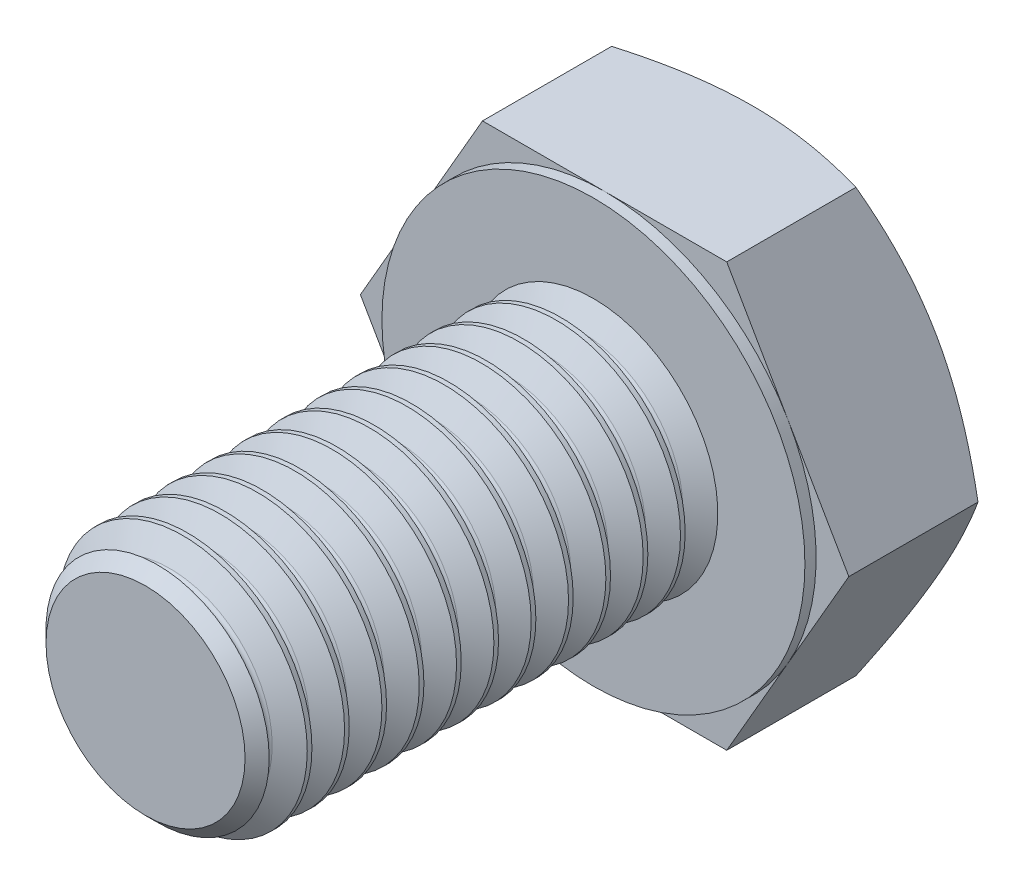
ISO-10303-21;
HEADER;
FILE_DESCRIPTION(('STEP AP214'),'2;1');
FILE_NAME('part.step','',(''),(''),'','','');
FILE_SCHEMA(('AUTOMOTIVE_DESIGN { 1 0 10303 214 1 1 1 1 }'));
ENDSEC;
DATA;
#1=APPLICATION_CONTEXT('core data for automotive mechanical design processes');
#2=APPLICATION_PROTOCOL_DEFINITION('international standard','automotive_design',2000,#1);
#3=PRODUCT_CONTEXT('',#1,'mechanical');
#4=PRODUCT('Part','Part','',(#3));
#5=PRODUCT_RELATED_PRODUCT_CATEGORY('part','',(#4));
#6=PRODUCT_DEFINITION_FORMATION('','',#4);
#7=PRODUCT_DEFINITION_CONTEXT('part definition',#1,'design');
#8=PRODUCT_DEFINITION('design','',#6,#7);
#9=PRODUCT_DEFINITION_SHAPE('','',#8);
#10=(LENGTH_UNIT() NAMED_UNIT(*) SI_UNIT(.MILLI.,.METRE.));
#11=(NAMED_UNIT(*) PLANE_ANGLE_UNIT() SI_UNIT($,.RADIAN.));
#12=(NAMED_UNIT(*) SI_UNIT($,.STERADIAN.) SOLID_ANGLE_UNIT());
#13=UNCERTAINTY_MEASURE_WITH_UNIT(LENGTH_MEASURE(1.E-05),#10,'distance_accuracy_value','');
#14=(GEOMETRIC_REPRESENTATION_CONTEXT(3) GLOBAL_UNCERTAINTY_ASSIGNED_CONTEXT((#13)) GLOBAL_UNIT_ASSIGNED_CONTEXT((#10,
#11,#12)) REPRESENTATION_CONTEXT('',''));
#15=CARTESIAN_POINT('',(0.,0.,0.));
#16=DIRECTION('',(0.,0.,1.));
#17=DIRECTION('',(1.,0.,0.));
#18=AXIS2_PLACEMENT_3D('',#15,#16,#17);
#19=CARTESIAN_POINT('',(0.,-8.5,-0.450000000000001));
#20=DIRECTION('',(0.,0.,1.));
#21=DIRECTION('',(0.,-1.,0.));
#22=AXIS2_PLACEMENT_3D('',#19,#20,#21);
#23=PLANE('',#22);
#24=DIRECTION('',(-0.5,-0.866025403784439,0.));
#25=VECTOR('',#24,1.);
#26=CARTESIAN_POINT('',(-11.0418238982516,-2.12500000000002,-0.449999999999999));
#27=LINE('',#26,#25);
#28=CARTESIAN_POINT('',(-7.36121593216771,4.24999999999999,-0.450000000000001));
#29=VERTEX_POINT('',#28);
#30=CARTESIAN_POINT('',(-9.8149545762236,0.,-0.449999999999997));
#31=VERTEX_POINT('',#30);
#32=EDGE_CURVE('E452',#29,#31,#27,.T.);
#33=ORIENTED_EDGE('',*,*,#32,.T.);
#34=DIRECTION('',(0.5,-0.866025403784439,0.));
#35=VECTOR('',#34,1.);
#36=CARTESIAN_POINT('',(-3.68060796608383,-10.625,-0.450000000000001));
#37=LINE('',#36,#35);
#38=CARTESIAN_POINT('',(-7.36121593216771,-4.24999999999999,-0.450000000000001));
#39=VERTEX_POINT('',#38);
#40=EDGE_CURVE('E493',#31,#39,#37,.T.);
#41=ORIENTED_EDGE('',*,*,#40,.T.);
#42=CARTESIAN_POINT('',(0.,0.,-0.449999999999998));
#43=DIRECTION('',(0.,0.,-1.));
#44=DIRECTION('',(0.,1.,0.));
#45=AXIS2_PLACEMENT_3D('',#42,#43,#44);
#46=CIRCLE('',#45,8.5);
#47=EDGE_CURVE('E488',#39,#29,#46,.T.);
#48=ORIENTED_EDGE('',*,*,#47,.T.);
#49=EDGE_LOOP('',(#33,#41,#48));
#50=FACE_BOUND('',#49,.T.);
#51=ADVANCED_FACE('F34',(#50),#23,.T.);
#52=CARTESIAN_POINT('',(0.,-8.5,-0.450000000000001));
#53=VERTEX_POINT('',#52);
#54=EDGE_CURVE('E413',#53,#39,#46,.T.);
#55=ORIENTED_EDGE('',*,*,#54,.T.);
#56=CARTESIAN_POINT('',(-4.90747728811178,-8.5,-0.45));
#57=VERTEX_POINT('',#56);
#58=EDGE_CURVE('E442',#39,#57,#37,.T.);
#59=ORIENTED_EDGE('',*,*,#58,.T.);
#60=DIRECTION('',(1.,0.,0.));
#61=VECTOR('',#60,1.);
#62=CARTESIAN_POINT('',(0.,-8.5,-0.450000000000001));
#63=LINE('',#62,#61);
#64=EDGE_CURVE('E205',#57,#53,#63,.T.);
#65=ORIENTED_EDGE('',*,*,#64,.T.);
#66=EDGE_LOOP('',(#55,#59,#65));
#67=FACE_BOUND('',#66,.T.);
#68=ADVANCED_FACE('F472',(#67),#23,.T.);
#69=CARTESIAN_POINT('',(7.36121593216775,-4.25000000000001,-0.450000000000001));
#70=VERTEX_POINT('',#69);
#71=EDGE_CURVE('E204',#70,#53,#46,.T.);
#72=ORIENTED_EDGE('',*,*,#71,.T.);
#73=CARTESIAN_POINT('',(4.90747728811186,-8.5,-0.450000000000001));
#74=VERTEX_POINT('',#73);
#75=EDGE_CURVE('E192',#53,#74,#63,.T.);
#76=ORIENTED_EDGE('',*,*,#75,.T.);
#77=DIRECTION('',(0.5,0.866025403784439,0.));
#78=VECTOR('',#77,1.);
#79=CARTESIAN_POINT('',(3.6806079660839,-10.625,-0.450000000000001));
#80=LINE('',#79,#78);
#81=EDGE_CURVE('E202',#74,#70,#80,.T.);
#82=ORIENTED_EDGE('',*,*,#81,.T.);
#83=EDGE_LOOP('',(#72,#76,#82));
#84=FACE_BOUND('',#83,.T.);
#85=ADVANCED_FACE('F201',(#84),#23,.T.);
#86=DIRECTION('',(-1.,0.,0.));
#87=VECTOR('',#86,1.);
#88=CARTESIAN_POINT('',(0.,8.5,-0.449999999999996));
#89=LINE('',#88,#87);
#90=CARTESIAN_POINT('',(0.,8.5,-0.450000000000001));
#91=VERTEX_POINT('',#90);
#92=CARTESIAN_POINT('',(-4.90747728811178,8.5,-0.449999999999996));
#93=VERTEX_POINT('',#92);
#94=EDGE_CURVE('E146',#91,#93,#89,.T.);
#95=ORIENTED_EDGE('',*,*,#94,.T.);
#96=EDGE_CURVE('E455',#93,#29,#27,.T.);
#97=ORIENTED_EDGE('',*,*,#96,.T.);
#98=EDGE_CURVE('E225',#29,#91,#46,.T.);
#99=ORIENTED_EDGE('',*,*,#98,.T.);
#100=EDGE_LOOP('',(#95,#97,#99));
#101=FACE_BOUND('',#100,.T.);
#102=ADVANCED_FACE('F484',(#101),#23,.T.);
#103=CARTESIAN_POINT('',(7.36121593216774,4.25000000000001,-0.450000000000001));
#104=VERTEX_POINT('',#103);
#105=EDGE_CURVE('E232',#104,#70,#46,.T.);
#106=ORIENTED_EDGE('',*,*,#105,.T.);
#107=CARTESIAN_POINT('',(9.81495457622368,0.,-0.449999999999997));
#108=VERTEX_POINT('',#107);
#109=EDGE_CURVE('E221',#70,#108,#80,.T.);
#110=ORIENTED_EDGE('',*,*,#109,.T.);
#111=DIRECTION('',(-0.5,0.866025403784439,0.));
#112=VECTOR('',#111,1.);
#113=CARTESIAN_POINT('',(11.0418238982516,-2.12499999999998,-0.449999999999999));
#114=LINE('',#113,#112);
#115=EDGE_CURVE('E144',#108,#104,#114,.T.);
#116=ORIENTED_EDGE('',*,*,#115,.T.);
#117=EDGE_LOOP('',(#106,#110,#116));
#118=FACE_BOUND('',#117,.T.);
#119=ADVANCED_FACE('F415',(#118),#23,.T.);
#120=CARTESIAN_POINT('',(4.90747728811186,8.5,-0.449999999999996));
#121=VERTEX_POINT('',#120);
#122=EDGE_CURVE('E129',#104,#121,#114,.T.);
#123=ORIENTED_EDGE('',*,*,#122,.T.);
#124=EDGE_CURVE('E136',#121,#91,#89,.T.);
#125=ORIENTED_EDGE('',*,*,#124,.T.);
#126=EDGE_CURVE('E228',#91,#104,#46,.T.);
#127=ORIENTED_EDGE('',*,*,#126,.T.);
#128=EDGE_LOOP('',(#123,#125,#127));
#129=FACE_BOUND('',#128,.T.);
#130=ADVANCED_FACE('F399',(#129),#23,.T.);
#131=CARTESIAN_POINT('',(0.,0.,0.));
#132=DIRECTION('',(0.,0.,-1.));
#133=DIRECTION('',(0.,1.,0.));
#134=AXIS2_PLACEMENT_3D('',#131,#132,#133);
#135=PLANE('',#134);
#136=CARTESIAN_POINT('',(0.,0.,0.));
#137=DIRECTION('',(0.,0.,-1.));
#138=DIRECTION('',(0.,1.,0.));
#139=AXIS2_PLACEMENT_3D('',#136,#137,#138);
#140=CIRCLE('',#139,5.);
#141=CARTESIAN_POINT('',(0.,5.,0.));
#142=VERTEX_POINT('',#141);
#143=EDGE_CURVE('E235',#142,#142,#140,.T.);
#144=ORIENTED_EDGE('',*,*,#143,.T.);
#145=EDGE_LOOP('',(#144));
#146=FACE_BOUND('',#145,.T.);
#147=CARTESIAN_POINT('',(0.,0.,0.));
#148=DIRECTION('',(0.,0.,-1.));
#149=DIRECTION('',(0.,1.,0.));
#150=AXIS2_PLACEMENT_3D('',#147,#148,#149);
#151=CIRCLE('',#150,8.5);
#152=CARTESIAN_POINT('',(0.,8.5,0.));
#153=VERTEX_POINT('',#152);
#154=EDGE_CURVE('E231',#153,#153,#151,.T.);
#155=ORIENTED_EDGE('',*,*,#154,.F.);
#156=EDGE_LOOP('',(#155));
#157=FACE_BOUND('',#156,.T.);
#158=ADVANCED_FACE('F396',(#146,#157),#135,.F.);
#159=CARTESIAN_POINT('',(0.,0.,18.));
#160=DIRECTION('',(0.,0.,1.));
#161=DIRECTION('',(1.,0.,0.));
#162=AXIS2_PLACEMENT_3D('',#159,#160,#161);
#163=CYLINDRICAL_SURFACE('',#162,5.);
#164=CARTESIAN_POINT('',(0.,0.,1.5));
#165=DIRECTION('',(0.,0.,1.));
#166=DIRECTION('',(1.,0.,0.));
#167=AXIS2_PLACEMENT_3D('',#164,#165,#166);
#168=CIRCLE('',#167,5.);
#169=CARTESIAN_POINT('',(5.,0.,1.5));
#170=VERTEX_POINT('',#169);
#171=EDGE_CURVE('E361',#170,#170,#168,.T.);
#172=ORIENTED_EDGE('',*,*,#171,.F.);
#173=EDGE_LOOP('',(#172));
#174=FACE_BOUND('',#173,.T.);
#175=CARTESIAN_POINT('',(0.,0.,1.3125));
#176=DIRECTION('',(0.,0.,1.));
#177=DIRECTION('',(1.,0.,0.));
#178=AXIS2_PLACEMENT_3D('',#175,#176,#177);
#179=CIRCLE('',#178,5.);
#180=CARTESIAN_POINT('',(5.,0.,1.3125));
#181=VERTEX_POINT('',#180);
#182=EDGE_CURVE('E43',#181,#181,#179,.T.);
#183=ORIENTED_EDGE('',*,*,#182,.T.);
#184=EDGE_LOOP('',(#183));
#185=FACE_BOUND('',#184,.T.);
#186=ADVANCED_FACE('F36',(#174,#185),#163,.T.);
#187=CARTESIAN_POINT('',(0.,0.,0.796874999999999));
#188=DIRECTION('',(0.,0.,1.));
#189=DIRECTION('',(1.,0.,0.));
#190=AXIS2_PLACEMENT_3D('',#187,#188,#189);
#191=CONICAL_SURFACE('',#190,4.1069113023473,1.04719755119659);
#192=ORIENTED_EDGE('',*,*,#182,.F.);
#193=EDGE_LOOP('',(#192));
#194=FACE_BOUND('',#193,.T.);
#195=CARTESIAN_POINT('',(0.,0.,0.796874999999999));
#196=DIRECTION('',(0.,0.,1.));
#197=DIRECTION('',(1.,0.,0.));
#198=AXIS2_PLACEMENT_3D('',#195,#196,#197);
#199=CIRCLE('',#198,4.1069113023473);
#200=CARTESIAN_POINT('',(4.1069113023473,0.,0.796874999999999));
#201=VERTEX_POINT('',#200);
#202=EDGE_CURVE('E367',#201,#201,#199,.T.);
#203=ORIENTED_EDGE('',*,*,#202,.T.);
#204=EDGE_LOOP('',(#203));
#205=FACE_BOUND('',#204,.T.);
#206=ADVANCED_FACE('F377',(#194,#205),#191,.T.);
#207=CARTESIAN_POINT('',(0.,0.,0.));
#208=DIRECTION('',(0.,0.,-1.));
#209=DIRECTION('',(-1.,0.,0.));
#210=AXIS2_PLACEMENT_3D('',#207,#208,#209);
#211=CONICAL_SURFACE('',#210,5.,1.0471975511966);
#212=CARTESIAN_POINT('',(0.,0.,0.515624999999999));
#213=DIRECTION('',(0.,0.,1.));
#214=DIRECTION('',(1.,0.,0.));
#215=AXIS2_PLACEMENT_3D('',#212,#213,#214);
#216=CIRCLE('',#215,4.1069113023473);
#217=CARTESIAN_POINT('',(4.1069113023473,0.,0.515624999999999));
#218=VERTEX_POINT('',#217);
#219=EDGE_CURVE('E370',#218,#218,#216,.T.);
#220=ORIENTED_EDGE('',*,*,#219,.F.);
#221=EDGE_LOOP('',(#220));
#222=FACE_BOUND('',#221,.T.);
#223=ORIENTED_EDGE('',*,*,#143,.F.);
#224=EDGE_LOOP('',(#223));
#225=FACE_BOUND('',#224,.T.);
#226=ADVANCED_FACE('F380',(#222,#225),#211,.T.);
#227=CARTESIAN_POINT('',(0.,0.,0.65625));
#228=DIRECTION('',(0.,0.,1.));
#229=DIRECTION('',(1.,0.,0.));
#230=AXIS2_PLACEMENT_3D('',#227,#228,#229);
#231=TOROIDAL_SURFACE('',#230,4.18810118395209,0.162379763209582);
#232=ORIENTED_EDGE('',*,*,#202,.F.);
#233=EDGE_LOOP('',(#232));
#234=FACE_BOUND('',#233,.T.);
#235=ORIENTED_EDGE('',*,*,#219,.T.);
#236=EDGE_LOOP('',(#235));
#237=FACE_BOUND('',#236,.T.);
#238=ADVANCED_FACE('F384',(#234,#237),#231,.F.);
#239=CARTESIAN_POINT('',(0.,0.,2.296875));
#240=DIRECTION('',(0.,0.,1.));
#241=DIRECTION('',(1.,0.,0.));
#242=AXIS2_PLACEMENT_3D('',#239,#240,#241);
#243=CONICAL_SURFACE('',#242,4.1069113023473,1.04719755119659);
#244=CARTESIAN_POINT('',(0.,0.,2.8125));
#245=DIRECTION('',(0.,0.,1.));
#246=DIRECTION('',(1.,0.,0.));
#247=AXIS2_PLACEMENT_3D('',#244,#245,#246);
#248=CIRCLE('',#247,5.);
#249=CARTESIAN_POINT('',(5.,0.,2.8125));
#250=VERTEX_POINT('',#249);
#251=EDGE_CURVE('E364',#250,#250,#248,.T.);
#252=ORIENTED_EDGE('',*,*,#251,.F.);
#253=EDGE_LOOP('',(#252));
#254=FACE_BOUND('',#253,.T.);
#255=CARTESIAN_POINT('',(0.,0.,2.296875));
#256=DIRECTION('',(0.,0.,1.));
#257=DIRECTION('',(1.,0.,0.));
#258=AXIS2_PLACEMENT_3D('',#255,#256,#257);
#259=CIRCLE('',#258,4.1069113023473);
#260=CARTESIAN_POINT('',(4.1069113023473,0.,2.296875));
#261=VERTEX_POINT('',#260);
#262=EDGE_CURVE('E355',#261,#261,#259,.T.);
#263=ORIENTED_EDGE('',*,*,#262,.T.);
#264=EDGE_LOOP('',(#263));
#265=FACE_BOUND('',#264,.T.);
#266=ADVANCED_FACE('F387',(#254,#265),#243,.T.);
#267=CARTESIAN_POINT('',(0.,0.,1.5));
#268=DIRECTION('',(0.,0.,-1.));
#269=DIRECTION('',(-1.,0.,0.));
#270=AXIS2_PLACEMENT_3D('',#267,#268,#269);
#271=CONICAL_SURFACE('',#270,5.,1.0471975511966);
#272=CARTESIAN_POINT('',(0.,0.,2.015625));
#273=DIRECTION('',(0.,0.,1.));
#274=DIRECTION('',(1.,0.,0.));
#275=AXIS2_PLACEMENT_3D('',#272,#273,#274);
#276=CIRCLE('',#275,4.1069113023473);
#277=CARTESIAN_POINT('',(4.1069113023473,0.,2.015625));
#278=VERTEX_POINT('',#277);
#279=EDGE_CURVE('E358',#278,#278,#276,.T.);
#280=ORIENTED_EDGE('',*,*,#279,.F.);
#281=EDGE_LOOP('',(#280));
#282=FACE_BOUND('',#281,.T.);
#283=ORIENTED_EDGE('',*,*,#171,.T.);
#284=EDGE_LOOP('',(#283));
#285=FACE_BOUND('',#284,.T.);
#286=ADVANCED_FACE('F1037',(#282,#285),#271,.T.);
#287=CARTESIAN_POINT('',(0.,0.,2.15625));
#288=DIRECTION('',(0.,0.,1.));
#289=DIRECTION('',(1.,0.,0.));
#290=AXIS2_PLACEMENT_3D('',#287,#288,#289);
#291=TOROIDAL_SURFACE('',#290,4.18810118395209,0.162379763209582);
#292=ORIENTED_EDGE('',*,*,#262,.F.);
#293=EDGE_LOOP('',(#292));
#294=FACE_BOUND('',#293,.T.);
#295=ORIENTED_EDGE('',*,*,#279,.T.);
#296=EDGE_LOOP('',(#295));
#297=FACE_BOUND('',#296,.T.);
#298=ADVANCED_FACE('F1028',(#294,#297),#291,.F.);
#299=CARTESIAN_POINT('',(0.,0.,3.));
#300=DIRECTION('',(0.,0.,1.));
#301=DIRECTION('',(1.,0.,0.));
#302=AXIS2_PLACEMENT_3D('',#299,#300,#301);
#303=CIRCLE('',#302,5.);
#304=CARTESIAN_POINT('',(5.,0.,3.));
#305=VERTEX_POINT('',#304);
#306=EDGE_CURVE('E349',#305,#305,#303,.T.);
#307=ORIENTED_EDGE('',*,*,#306,.F.);
#308=EDGE_LOOP('',(#307));
#309=FACE_BOUND('',#308,.T.);
#310=ORIENTED_EDGE('',*,*,#251,.T.);
#311=EDGE_LOOP('',(#310));
#312=FACE_BOUND('',#311,.T.);
#313=ADVANCED_FACE('F991',(#309,#312),#163,.T.);
#314=CARTESIAN_POINT('',(0.,0.,3.796875));
#315=DIRECTION('',(0.,0.,1.));
#316=DIRECTION('',(1.,0.,0.));
#317=AXIS2_PLACEMENT_3D('',#314,#315,#316);
#318=CONICAL_SURFACE('',#317,4.1069113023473,1.04719755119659);
#319=CARTESIAN_POINT('',(0.,0.,4.3125));
#320=DIRECTION('',(0.,0.,1.));
#321=DIRECTION('',(1.,0.,0.));
#322=AXIS2_PLACEMENT_3D('',#319,#320,#321);
#323=CIRCLE('',#322,5.);
#324=CARTESIAN_POINT('',(5.,0.,4.3125));
#325=VERTEX_POINT('',#324);
#326=EDGE_CURVE('E352',#325,#325,#323,.T.);
#327=ORIENTED_EDGE('',*,*,#326,.F.);
#328=EDGE_LOOP('',(#327));
#329=FACE_BOUND('',#328,.T.);
#330=CARTESIAN_POINT('',(0.,0.,3.796875));
#331=DIRECTION('',(0.,0.,1.));
#332=DIRECTION('',(1.,0.,0.));
#333=AXIS2_PLACEMENT_3D('',#330,#331,#332);
#334=CIRCLE('',#333,4.1069113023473);
#335=CARTESIAN_POINT('',(4.1069113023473,0.,3.796875));
#336=VERTEX_POINT('',#335);
#337=EDGE_CURVE('E343',#336,#336,#334,.T.);
#338=ORIENTED_EDGE('',*,*,#337,.T.);
#339=EDGE_LOOP('',(#338));
#340=FACE_BOUND('',#339,.T.);
#341=ADVANCED_FACE('F1009',(#329,#340),#318,.T.);
#342=CARTESIAN_POINT('',(0.,0.,3.));
#343=DIRECTION('',(0.,0.,-1.));
#344=DIRECTION('',(-1.,0.,0.));
#345=AXIS2_PLACEMENT_3D('',#342,#343,#344);
#346=CONICAL_SURFACE('',#345,5.,1.0471975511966);
#347=CARTESIAN_POINT('',(0.,0.,3.515625));
#348=DIRECTION('',(0.,0.,1.));
#349=DIRECTION('',(1.,0.,0.));
#350=AXIS2_PLACEMENT_3D('',#347,#348,#349);
#351=CIRCLE('',#350,4.1069113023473);
#352=CARTESIAN_POINT('',(4.1069113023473,0.,3.515625));
#353=VERTEX_POINT('',#352);
#354=EDGE_CURVE('E346',#353,#353,#351,.T.);
#355=ORIENTED_EDGE('',*,*,#354,.F.);
#356=EDGE_LOOP('',(#355));
#357=FACE_BOUND('',#356,.T.);
#358=ORIENTED_EDGE('',*,*,#306,.T.);
#359=EDGE_LOOP('',(#358));
#360=FACE_BOUND('',#359,.T.);
#361=ADVANCED_FACE('F999',(#357,#360),#346,.T.);
#362=CARTESIAN_POINT('',(0.,0.,3.65625));
#363=DIRECTION('',(0.,0.,1.));
#364=DIRECTION('',(1.,0.,0.));
#365=AXIS2_PLACEMENT_3D('',#362,#363,#364);
#366=TOROIDAL_SURFACE('',#365,4.18810118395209,0.162379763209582);
#367=ORIENTED_EDGE('',*,*,#337,.F.);
#368=EDGE_LOOP('',(#367));
#369=FACE_BOUND('',#368,.T.);
#370=ORIENTED_EDGE('',*,*,#354,.T.);
#371=EDGE_LOOP('',(#370));
#372=FACE_BOUND('',#371,.T.);
#373=ADVANCED_FACE('F989',(#369,#372),#366,.F.);
#374=CARTESIAN_POINT('',(0.,0.,4.5));
#375=DIRECTION('',(0.,0.,1.));
#376=DIRECTION('',(1.,0.,0.));
#377=AXIS2_PLACEMENT_3D('',#374,#375,#376);
#378=CIRCLE('',#377,5.);
#379=CARTESIAN_POINT('',(5.,0.,4.5));
#380=VERTEX_POINT('',#379);
#381=EDGE_CURVE('E337',#380,#380,#378,.T.);
#382=ORIENTED_EDGE('',*,*,#381,.F.);
#383=EDGE_LOOP('',(#382));
#384=FACE_BOUND('',#383,.T.);
#385=ORIENTED_EDGE('',*,*,#326,.T.);
#386=EDGE_LOOP('',(#385));
#387=FACE_BOUND('',#386,.T.);
#388=ADVANCED_FACE('F952',(#384,#387),#163,.T.);
#389=CARTESIAN_POINT('',(0.,0.,5.296875));
#390=DIRECTION('',(0.,0.,1.));
#391=DIRECTION('',(1.,0.,0.));
#392=AXIS2_PLACEMENT_3D('',#389,#390,#391);
#393=CONICAL_SURFACE('',#392,4.1069113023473,1.04719755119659);
#394=CARTESIAN_POINT('',(0.,0.,5.8125));
#395=DIRECTION('',(0.,0.,1.));
#396=DIRECTION('',(1.,0.,0.));
#397=AXIS2_PLACEMENT_3D('',#394,#395,#396);
#398=CIRCLE('',#397,5.);
#399=CARTESIAN_POINT('',(5.,0.,5.8125));
#400=VERTEX_POINT('',#399);
#401=EDGE_CURVE('E340',#400,#400,#398,.T.);
#402=ORIENTED_EDGE('',*,*,#401,.F.);
#403=EDGE_LOOP('',(#402));
#404=FACE_BOUND('',#403,.T.);
#405=CARTESIAN_POINT('',(0.,0.,5.296875));
#406=DIRECTION('',(0.,0.,1.));
#407=DIRECTION('',(1.,0.,0.));
#408=AXIS2_PLACEMENT_3D('',#405,#406,#407);
#409=CIRCLE('',#408,4.1069113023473);
#410=CARTESIAN_POINT('',(4.1069113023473,0.,5.296875));
#411=VERTEX_POINT('',#410);
#412=EDGE_CURVE('E331',#411,#411,#409,.T.);
#413=ORIENTED_EDGE('',*,*,#412,.T.);
#414=EDGE_LOOP('',(#413));
#415=FACE_BOUND('',#414,.T.);
#416=ADVANCED_FACE('F970',(#404,#415),#393,.T.);
#417=CARTESIAN_POINT('',(0.,0.,4.5));
#418=DIRECTION('',(0.,0.,-1.));
#419=DIRECTION('',(-1.,0.,0.));
#420=AXIS2_PLACEMENT_3D('',#417,#418,#419);
#421=CONICAL_SURFACE('',#420,5.,1.0471975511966);
#422=CARTESIAN_POINT('',(0.,0.,5.015625));
#423=DIRECTION('',(0.,0.,1.));
#424=DIRECTION('',(1.,0.,0.));
#425=AXIS2_PLACEMENT_3D('',#422,#423,#424);
#426=CIRCLE('',#425,4.1069113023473);
#427=CARTESIAN_POINT('',(4.1069113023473,0.,5.015625));
#428=VERTEX_POINT('',#427);
#429=EDGE_CURVE('E334',#428,#428,#426,.T.);
#430=ORIENTED_EDGE('',*,*,#429,.F.);
#431=EDGE_LOOP('',(#430));
#432=FACE_BOUND('',#431,.T.);
#433=ORIENTED_EDGE('',*,*,#381,.T.);
#434=EDGE_LOOP('',(#433));
#435=FACE_BOUND('',#434,.T.);
#436=ADVANCED_FACE('F960',(#432,#435),#421,.T.);
#437=CARTESIAN_POINT('',(0.,0.,5.15625));
#438=DIRECTION('',(0.,0.,1.));
#439=DIRECTION('',(1.,0.,0.));
#440=AXIS2_PLACEMENT_3D('',#437,#438,#439);
#441=TOROIDAL_SURFACE('',#440,4.18810118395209,0.162379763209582);
#442=ORIENTED_EDGE('',*,*,#412,.F.);
#443=EDGE_LOOP('',(#442));
#444=FACE_BOUND('',#443,.T.);
#445=ORIENTED_EDGE('',*,*,#429,.T.);
#446=EDGE_LOOP('',(#445));
#447=FACE_BOUND('',#446,.T.);
#448=ADVANCED_FACE('F950',(#444,#447),#441,.F.);
#449=CARTESIAN_POINT('',(0.,0.,6.));
#450=DIRECTION('',(0.,0.,1.));
#451=DIRECTION('',(1.,0.,0.));
#452=AXIS2_PLACEMENT_3D('',#449,#450,#451);
#453=CIRCLE('',#452,5.);
#454=CARTESIAN_POINT('',(5.,0.,6.));
#455=VERTEX_POINT('',#454);
#456=EDGE_CURVE('E325',#455,#455,#453,.T.);
#457=ORIENTED_EDGE('',*,*,#456,.F.);
#458=EDGE_LOOP('',(#457));
#459=FACE_BOUND('',#458,.T.);
#460=ORIENTED_EDGE('',*,*,#401,.T.);
#461=EDGE_LOOP('',(#460));
#462=FACE_BOUND('',#461,.T.);
#463=ADVANCED_FACE('F913',(#459,#462),#163,.T.);
#464=CARTESIAN_POINT('',(0.,0.,6.796875));
#465=DIRECTION('',(0.,0.,1.));
#466=DIRECTION('',(1.,0.,0.));
#467=AXIS2_PLACEMENT_3D('',#464,#465,#466);
#468=CONICAL_SURFACE('',#467,4.1069113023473,1.04719755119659);
#469=CARTESIAN_POINT('',(0.,0.,7.3125));
#470=DIRECTION('',(0.,0.,1.));
#471=DIRECTION('',(1.,0.,0.));
#472=AXIS2_PLACEMENT_3D('',#469,#470,#471);
#473=CIRCLE('',#472,5.);
#474=CARTESIAN_POINT('',(5.,0.,7.3125));
#475=VERTEX_POINT('',#474);
#476=EDGE_CURVE('E328',#475,#475,#473,.T.);
#477=ORIENTED_EDGE('',*,*,#476,.F.);
#478=EDGE_LOOP('',(#477));
#479=FACE_BOUND('',#478,.T.);
#480=CARTESIAN_POINT('',(0.,0.,6.796875));
#481=DIRECTION('',(0.,0.,1.));
#482=DIRECTION('',(1.,0.,0.));
#483=AXIS2_PLACEMENT_3D('',#480,#481,#482);
#484=CIRCLE('',#483,4.1069113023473);
#485=CARTESIAN_POINT('',(4.1069113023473,0.,6.796875));
#486=VERTEX_POINT('',#485);
#487=EDGE_CURVE('E319',#486,#486,#484,.T.);
#488=ORIENTED_EDGE('',*,*,#487,.T.);
#489=EDGE_LOOP('',(#488));
#490=FACE_BOUND('',#489,.T.);
#491=ADVANCED_FACE('F931',(#479,#490),#468,.T.);
#492=CARTESIAN_POINT('',(0.,0.,6.));
#493=DIRECTION('',(0.,0.,-1.));
#494=DIRECTION('',(-1.,0.,0.));
#495=AXIS2_PLACEMENT_3D('',#492,#493,#494);
#496=CONICAL_SURFACE('',#495,5.,1.0471975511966);
#497=CARTESIAN_POINT('',(0.,0.,6.515625));
#498=DIRECTION('',(0.,0.,1.));
#499=DIRECTION('',(1.,0.,0.));
#500=AXIS2_PLACEMENT_3D('',#497,#498,#499);
#501=CIRCLE('',#500,4.1069113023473);
#502=CARTESIAN_POINT('',(4.1069113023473,0.,6.515625));
#503=VERTEX_POINT('',#502);
#504=EDGE_CURVE('E322',#503,#503,#501,.T.);
#505=ORIENTED_EDGE('',*,*,#504,.F.);
#506=EDGE_LOOP('',(#505));
#507=FACE_BOUND('',#506,.T.);
#508=ORIENTED_EDGE('',*,*,#456,.T.);
#509=EDGE_LOOP('',(#508));
#510=FACE_BOUND('',#509,.T.);
#511=ADVANCED_FACE('F921',(#507,#510),#496,.T.);
#512=CARTESIAN_POINT('',(0.,0.,6.65625));
#513=DIRECTION('',(0.,0.,1.));
#514=DIRECTION('',(1.,0.,0.));
#515=AXIS2_PLACEMENT_3D('',#512,#513,#514);
#516=TOROIDAL_SURFACE('',#515,4.18810118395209,0.162379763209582);
#517=ORIENTED_EDGE('',*,*,#487,.F.);
#518=EDGE_LOOP('',(#517));
#519=FACE_BOUND('',#518,.T.);
#520=ORIENTED_EDGE('',*,*,#504,.T.);
#521=EDGE_LOOP('',(#520));
#522=FACE_BOUND('',#521,.T.);
#523=ADVANCED_FACE('F911',(#519,#522),#516,.F.);
#524=CARTESIAN_POINT('',(0.,0.,7.5));
#525=DIRECTION('',(0.,0.,1.));
#526=DIRECTION('',(1.,0.,0.));
#527=AXIS2_PLACEMENT_3D('',#524,#525,#526);
#528=CIRCLE('',#527,5.);
#529=CARTESIAN_POINT('',(5.,0.,7.5));
#530=VERTEX_POINT('',#529);
#531=EDGE_CURVE('E313',#530,#530,#528,.T.);
#532=ORIENTED_EDGE('',*,*,#531,.F.);
#533=EDGE_LOOP('',(#532));
#534=FACE_BOUND('',#533,.T.);
#535=ORIENTED_EDGE('',*,*,#476,.T.);
#536=EDGE_LOOP('',(#535));
#537=FACE_BOUND('',#536,.T.);
#538=ADVANCED_FACE('F874',(#534,#537),#163,.T.);
#539=CARTESIAN_POINT('',(0.,0.,8.296875));
#540=DIRECTION('',(0.,0.,1.));
#541=DIRECTION('',(1.,0.,0.));
#542=AXIS2_PLACEMENT_3D('',#539,#540,#541);
#543=CONICAL_SURFACE('',#542,4.1069113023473,1.04719755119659);
#544=CARTESIAN_POINT('',(0.,0.,8.8125));
#545=DIRECTION('',(0.,0.,1.));
#546=DIRECTION('',(1.,0.,0.));
#547=AXIS2_PLACEMENT_3D('',#544,#545,#546);
#548=CIRCLE('',#547,5.);
#549=CARTESIAN_POINT('',(5.,0.,8.8125));
#550=VERTEX_POINT('',#549);
#551=EDGE_CURVE('E316',#550,#550,#548,.T.);
#552=ORIENTED_EDGE('',*,*,#551,.F.);
#553=EDGE_LOOP('',(#552));
#554=FACE_BOUND('',#553,.T.);
#555=CARTESIAN_POINT('',(0.,0.,8.296875));
#556=DIRECTION('',(0.,0.,1.));
#557=DIRECTION('',(1.,0.,0.));
#558=AXIS2_PLACEMENT_3D('',#555,#556,#557);
#559=CIRCLE('',#558,4.1069113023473);
#560=CARTESIAN_POINT('',(4.1069113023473,0.,8.296875));
#561=VERTEX_POINT('',#560);
#562=EDGE_CURVE('E307',#561,#561,#559,.T.);
#563=ORIENTED_EDGE('',*,*,#562,.T.);
#564=EDGE_LOOP('',(#563));
#565=FACE_BOUND('',#564,.T.);
#566=ADVANCED_FACE('F892',(#554,#565),#543,.T.);
#567=CARTESIAN_POINT('',(0.,0.,7.5));
#568=DIRECTION('',(0.,0.,-1.));
#569=DIRECTION('',(-1.,0.,0.));
#570=AXIS2_PLACEMENT_3D('',#567,#568,#569);
#571=CONICAL_SURFACE('',#570,5.,1.0471975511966);
#572=CARTESIAN_POINT('',(0.,0.,8.015625));
#573=DIRECTION('',(0.,0.,1.));
#574=DIRECTION('',(1.,0.,0.));
#575=AXIS2_PLACEMENT_3D('',#572,#573,#574);
#576=CIRCLE('',#575,4.1069113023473);
#577=CARTESIAN_POINT('',(4.1069113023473,0.,8.015625));
#578=VERTEX_POINT('',#577);
#579=EDGE_CURVE('E310',#578,#578,#576,.T.);
#580=ORIENTED_EDGE('',*,*,#579,.F.);
#581=EDGE_LOOP('',(#580));
#582=FACE_BOUND('',#581,.T.);
#583=ORIENTED_EDGE('',*,*,#531,.T.);
#584=EDGE_LOOP('',(#583));
#585=FACE_BOUND('',#584,.T.);
#586=ADVANCED_FACE('F882',(#582,#585),#571,.T.);
#587=CARTESIAN_POINT('',(0.,0.,8.15625));
#588=DIRECTION('',(0.,0.,1.));
#589=DIRECTION('',(1.,0.,0.));
#590=AXIS2_PLACEMENT_3D('',#587,#588,#589);
#591=TOROIDAL_SURFACE('',#590,4.18810118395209,0.162379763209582);
#592=ORIENTED_EDGE('',*,*,#562,.F.);
#593=EDGE_LOOP('',(#592));
#594=FACE_BOUND('',#593,.T.);
#595=ORIENTED_EDGE('',*,*,#579,.T.);
#596=EDGE_LOOP('',(#595));
#597=FACE_BOUND('',#596,.T.);
#598=ADVANCED_FACE('F872',(#594,#597),#591,.F.);
#599=CARTESIAN_POINT('',(0.,0.,9.));
#600=DIRECTION('',(0.,0.,1.));
#601=DIRECTION('',(1.,0.,0.));
#602=AXIS2_PLACEMENT_3D('',#599,#600,#601);
#603=CIRCLE('',#602,5.);
#604=CARTESIAN_POINT('',(5.,0.,9.));
#605=VERTEX_POINT('',#604);
#606=EDGE_CURVE('E301',#605,#605,#603,.T.);
#607=ORIENTED_EDGE('',*,*,#606,.F.);
#608=EDGE_LOOP('',(#607));
#609=FACE_BOUND('',#608,.T.);
#610=ORIENTED_EDGE('',*,*,#551,.T.);
#611=EDGE_LOOP('',(#610));
#612=FACE_BOUND('',#611,.T.);
#613=ADVANCED_FACE('F835',(#609,#612),#163,.T.);
#614=CARTESIAN_POINT('',(0.,0.,9.796875));
#615=DIRECTION('',(0.,0.,1.));
#616=DIRECTION('',(1.,0.,0.));
#617=AXIS2_PLACEMENT_3D('',#614,#615,#616);
#618=CONICAL_SURFACE('',#617,4.1069113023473,1.04719755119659);
#619=CARTESIAN_POINT('',(0.,0.,10.3125));
#620=DIRECTION('',(0.,0.,1.));
#621=DIRECTION('',(1.,0.,0.));
#622=AXIS2_PLACEMENT_3D('',#619,#620,#621);
#623=CIRCLE('',#622,5.);
#624=CARTESIAN_POINT('',(5.,0.,10.3125));
#625=VERTEX_POINT('',#624);
#626=EDGE_CURVE('E304',#625,#625,#623,.T.);
#627=ORIENTED_EDGE('',*,*,#626,.F.);
#628=EDGE_LOOP('',(#627));
#629=FACE_BOUND('',#628,.T.);
#630=CARTESIAN_POINT('',(0.,0.,9.796875));
#631=DIRECTION('',(0.,0.,1.));
#632=DIRECTION('',(1.,0.,0.));
#633=AXIS2_PLACEMENT_3D('',#630,#631,#632);
#634=CIRCLE('',#633,4.1069113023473);
#635=CARTESIAN_POINT('',(4.1069113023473,0.,9.796875));
#636=VERTEX_POINT('',#635);
#637=EDGE_CURVE('E295',#636,#636,#634,.T.);
#638=ORIENTED_EDGE('',*,*,#637,.T.);
#639=EDGE_LOOP('',(#638));
#640=FACE_BOUND('',#639,.T.);
#641=ADVANCED_FACE('F853',(#629,#640),#618,.T.);
#642=CARTESIAN_POINT('',(0.,0.,9.));
#643=DIRECTION('',(0.,0.,-1.));
#644=DIRECTION('',(-1.,0.,0.));
#645=AXIS2_PLACEMENT_3D('',#642,#643,#644);
#646=CONICAL_SURFACE('',#645,5.,1.0471975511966);
#647=CARTESIAN_POINT('',(0.,0.,9.515625));
#648=DIRECTION('',(0.,0.,1.));
#649=DIRECTION('',(1.,0.,0.));
#650=AXIS2_PLACEMENT_3D('',#647,#648,#649);
#651=CIRCLE('',#650,4.1069113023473);
#652=CARTESIAN_POINT('',(4.1069113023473,0.,9.515625));
#653=VERTEX_POINT('',#652);
#654=EDGE_CURVE('E298',#653,#653,#651,.T.);
#655=ORIENTED_EDGE('',*,*,#654,.F.);
#656=EDGE_LOOP('',(#655));
#657=FACE_BOUND('',#656,.T.);
#658=ORIENTED_EDGE('',*,*,#606,.T.);
#659=EDGE_LOOP('',(#658));
#660=FACE_BOUND('',#659,.T.);
#661=ADVANCED_FACE('F843',(#657,#660),#646,.T.);
#662=CARTESIAN_POINT('',(0.,0.,9.65625));
#663=DIRECTION('',(0.,0.,1.));
#664=DIRECTION('',(1.,0.,0.));
#665=AXIS2_PLACEMENT_3D('',#662,#663,#664);
#666=TOROIDAL_SURFACE('',#665,4.18810118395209,0.162379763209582);
#667=ORIENTED_EDGE('',*,*,#637,.F.);
#668=EDGE_LOOP('',(#667));
#669=FACE_BOUND('',#668,.T.);
#670=ORIENTED_EDGE('',*,*,#654,.T.);
#671=EDGE_LOOP('',(#670));
#672=FACE_BOUND('',#671,.T.);
#673=ADVANCED_FACE('F833',(#669,#672),#666,.F.);
#674=CARTESIAN_POINT('',(0.,0.,10.5));
#675=DIRECTION('',(0.,0.,1.));
#676=DIRECTION('',(1.,0.,0.));
#677=AXIS2_PLACEMENT_3D('',#674,#675,#676);
#678=CIRCLE('',#677,5.);
#679=CARTESIAN_POINT('',(5.,0.,10.5));
#680=VERTEX_POINT('',#679);
#681=EDGE_CURVE('E289',#680,#680,#678,.T.);
#682=ORIENTED_EDGE('',*,*,#681,.F.);
#683=EDGE_LOOP('',(#682));
#684=FACE_BOUND('',#683,.T.);
#685=ORIENTED_EDGE('',*,*,#626,.T.);
#686=EDGE_LOOP('',(#685));
#687=FACE_BOUND('',#686,.T.);
#688=ADVANCED_FACE('F796',(#684,#687),#163,.T.);
#689=CARTESIAN_POINT('',(0.,0.,11.296875));
#690=DIRECTION('',(0.,0.,1.));
#691=DIRECTION('',(1.,0.,0.));
#692=AXIS2_PLACEMENT_3D('',#689,#690,#691);
#693=CONICAL_SURFACE('',#692,4.1069113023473,1.04719755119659);
#694=CARTESIAN_POINT('',(0.,0.,11.8125));
#695=DIRECTION('',(0.,0.,1.));
#696=DIRECTION('',(1.,0.,0.));
#697=AXIS2_PLACEMENT_3D('',#694,#695,#696);
#698=CIRCLE('',#697,5.);
#699=CARTESIAN_POINT('',(5.,0.,11.8125));
#700=VERTEX_POINT('',#699);
#701=EDGE_CURVE('E292',#700,#700,#698,.T.);
#702=ORIENTED_EDGE('',*,*,#701,.F.);
#703=EDGE_LOOP('',(#702));
#704=FACE_BOUND('',#703,.T.);
#705=CARTESIAN_POINT('',(0.,0.,11.296875));
#706=DIRECTION('',(0.,0.,1.));
#707=DIRECTION('',(1.,0.,0.));
#708=AXIS2_PLACEMENT_3D('',#705,#706,#707);
#709=CIRCLE('',#708,4.1069113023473);
#710=CARTESIAN_POINT('',(4.1069113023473,0.,11.296875));
#711=VERTEX_POINT('',#710);
#712=EDGE_CURVE('E283',#711,#711,#709,.T.);
#713=ORIENTED_EDGE('',*,*,#712,.T.);
#714=EDGE_LOOP('',(#713));
#715=FACE_BOUND('',#714,.T.);
#716=ADVANCED_FACE('F814',(#704,#715),#693,.T.);
#717=CARTESIAN_POINT('',(0.,0.,10.5));
#718=DIRECTION('',(0.,0.,-1.));
#719=DIRECTION('',(-1.,0.,0.));
#720=AXIS2_PLACEMENT_3D('',#717,#718,#719);
#721=CONICAL_SURFACE('',#720,5.,1.0471975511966);
#722=CARTESIAN_POINT('',(0.,0.,11.015625));
#723=DIRECTION('',(0.,0.,1.));
#724=DIRECTION('',(1.,0.,0.));
#725=AXIS2_PLACEMENT_3D('',#722,#723,#724);
#726=CIRCLE('',#725,4.1069113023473);
#727=CARTESIAN_POINT('',(4.1069113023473,0.,11.015625));
#728=VERTEX_POINT('',#727);
#729=EDGE_CURVE('E286',#728,#728,#726,.T.);
#730=ORIENTED_EDGE('',*,*,#729,.F.);
#731=EDGE_LOOP('',(#730));
#732=FACE_BOUND('',#731,.T.);
#733=ORIENTED_EDGE('',*,*,#681,.T.);
#734=EDGE_LOOP('',(#733));
#735=FACE_BOUND('',#734,.T.);
#736=ADVANCED_FACE('F804',(#732,#735),#721,.T.);
#737=CARTESIAN_POINT('',(0.,0.,11.15625));
#738=DIRECTION('',(0.,0.,1.));
#739=DIRECTION('',(1.,0.,0.));
#740=AXIS2_PLACEMENT_3D('',#737,#738,#739);
#741=TOROIDAL_SURFACE('',#740,4.18810118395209,0.162379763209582);
#742=ORIENTED_EDGE('',*,*,#712,.F.);
#743=EDGE_LOOP('',(#742));
#744=FACE_BOUND('',#743,.T.);
#745=ORIENTED_EDGE('',*,*,#729,.T.);
#746=EDGE_LOOP('',(#745));
#747=FACE_BOUND('',#746,.T.);
#748=ADVANCED_FACE('F794',(#744,#747),#741,.F.);
#749=CARTESIAN_POINT('',(0.,0.,12.));
#750=DIRECTION('',(0.,0.,1.));
#751=DIRECTION('',(1.,0.,0.));
#752=AXIS2_PLACEMENT_3D('',#749,#750,#751);
#753=CIRCLE('',#752,5.);
#754=CARTESIAN_POINT('',(5.,0.,12.));
#755=VERTEX_POINT('',#754);
#756=EDGE_CURVE('E277',#755,#755,#753,.T.);
#757=ORIENTED_EDGE('',*,*,#756,.F.);
#758=EDGE_LOOP('',(#757));
#759=FACE_BOUND('',#758,.T.);
#760=ORIENTED_EDGE('',*,*,#701,.T.);
#761=EDGE_LOOP('',(#760));
#762=FACE_BOUND('',#761,.T.);
#763=ADVANCED_FACE('F757',(#759,#762),#163,.T.);
#764=CARTESIAN_POINT('',(0.,0.,12.796875));
#765=DIRECTION('',(0.,0.,1.));
#766=DIRECTION('',(1.,0.,0.));
#767=AXIS2_PLACEMENT_3D('',#764,#765,#766);
#768=CONICAL_SURFACE('',#767,4.1069113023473,1.04719755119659);
#769=CARTESIAN_POINT('',(0.,0.,13.3125));
#770=DIRECTION('',(0.,0.,1.));
#771=DIRECTION('',(1.,0.,0.));
#772=AXIS2_PLACEMENT_3D('',#769,#770,#771);
#773=CIRCLE('',#772,5.);
#774=CARTESIAN_POINT('',(5.,0.,13.3125));
#775=VERTEX_POINT('',#774);
#776=EDGE_CURVE('E280',#775,#775,#773,.T.);
#777=ORIENTED_EDGE('',*,*,#776,.F.);
#778=EDGE_LOOP('',(#777));
#779=FACE_BOUND('',#778,.T.);
#780=CARTESIAN_POINT('',(0.,0.,12.796875));
#781=DIRECTION('',(0.,0.,1.));
#782=DIRECTION('',(1.,0.,0.));
#783=AXIS2_PLACEMENT_3D('',#780,#781,#782);
#784=CIRCLE('',#783,4.1069113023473);
#785=CARTESIAN_POINT('',(4.1069113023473,0.,12.796875));
#786=VERTEX_POINT('',#785);
#787=EDGE_CURVE('E271',#786,#786,#784,.T.);
#788=ORIENTED_EDGE('',*,*,#787,.T.);
#789=EDGE_LOOP('',(#788));
#790=FACE_BOUND('',#789,.T.);
#791=ADVANCED_FACE('F775',(#779,#790),#768,.T.);
#792=CARTESIAN_POINT('',(0.,0.,12.));
#793=DIRECTION('',(0.,0.,-1.));
#794=DIRECTION('',(-1.,0.,0.));
#795=AXIS2_PLACEMENT_3D('',#792,#793,#794);
#796=CONICAL_SURFACE('',#795,5.,1.0471975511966);
#797=CARTESIAN_POINT('',(0.,0.,12.515625));
#798=DIRECTION('',(0.,0.,1.));
#799=DIRECTION('',(1.,0.,0.));
#800=AXIS2_PLACEMENT_3D('',#797,#798,#799);
#801=CIRCLE('',#800,4.1069113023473);
#802=CARTESIAN_POINT('',(4.1069113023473,0.,12.515625));
#803=VERTEX_POINT('',#802);
#804=EDGE_CURVE('E274',#803,#803,#801,.T.);
#805=ORIENTED_EDGE('',*,*,#804,.F.);
#806=EDGE_LOOP('',(#805));
#807=FACE_BOUND('',#806,.T.);
#808=ORIENTED_EDGE('',*,*,#756,.T.);
#809=EDGE_LOOP('',(#808));
#810=FACE_BOUND('',#809,.T.);
#811=ADVANCED_FACE('F765',(#807,#810),#796,.T.);
#812=CARTESIAN_POINT('',(0.,0.,12.65625));
#813=DIRECTION('',(0.,0.,1.));
#814=DIRECTION('',(1.,0.,0.));
#815=AXIS2_PLACEMENT_3D('',#812,#813,#814);
#816=TOROIDAL_SURFACE('',#815,4.18810118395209,0.162379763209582);
#817=ORIENTED_EDGE('',*,*,#787,.F.);
#818=EDGE_LOOP('',(#817));
#819=FACE_BOUND('',#818,.T.);
#820=ORIENTED_EDGE('',*,*,#804,.T.);
#821=EDGE_LOOP('',(#820));
#822=FACE_BOUND('',#821,.T.);
#823=ADVANCED_FACE('F755',(#819,#822),#816,.F.);
#824=CARTESIAN_POINT('',(0.,0.,13.5));
#825=DIRECTION('',(0.,0.,1.));
#826=DIRECTION('',(1.,0.,0.));
#827=AXIS2_PLACEMENT_3D('',#824,#825,#826);
#828=CIRCLE('',#827,5.);
#829=CARTESIAN_POINT('',(5.,0.,13.5));
#830=VERTEX_POINT('',#829);
#831=EDGE_CURVE('E265',#830,#830,#828,.T.);
#832=ORIENTED_EDGE('',*,*,#831,.F.);
#833=EDGE_LOOP('',(#832));
#834=FACE_BOUND('',#833,.T.);
#835=ORIENTED_EDGE('',*,*,#776,.T.);
#836=EDGE_LOOP('',(#835));
#837=FACE_BOUND('',#836,.T.);
#838=ADVANCED_FACE('F718',(#834,#837),#163,.T.);
#839=CARTESIAN_POINT('',(0.,0.,14.296875));
#840=DIRECTION('',(0.,0.,1.));
#841=DIRECTION('',(1.,0.,0.));
#842=AXIS2_PLACEMENT_3D('',#839,#840,#841);
#843=CONICAL_SURFACE('',#842,4.1069113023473,1.04719755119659);
#844=CARTESIAN_POINT('',(0.,0.,14.8125));
#845=DIRECTION('',(0.,0.,1.));
#846=DIRECTION('',(1.,0.,0.));
#847=AXIS2_PLACEMENT_3D('',#844,#845,#846);
#848=CIRCLE('',#847,5.);
#849=CARTESIAN_POINT('',(5.,0.,14.8125));
#850=VERTEX_POINT('',#849);
#851=EDGE_CURVE('E268',#850,#850,#848,.T.);
#852=ORIENTED_EDGE('',*,*,#851,.F.);
#853=EDGE_LOOP('',(#852));
#854=FACE_BOUND('',#853,.T.);
#855=CARTESIAN_POINT('',(0.,0.,14.296875));
#856=DIRECTION('',(0.,0.,1.));
#857=DIRECTION('',(1.,0.,0.));
#858=AXIS2_PLACEMENT_3D('',#855,#856,#857);
#859=CIRCLE('',#858,4.1069113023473);
#860=CARTESIAN_POINT('',(4.1069113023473,0.,14.296875));
#861=VERTEX_POINT('',#860);
#862=EDGE_CURVE('E259',#861,#861,#859,.T.);
#863=ORIENTED_EDGE('',*,*,#862,.T.);
#864=EDGE_LOOP('',(#863));
#865=FACE_BOUND('',#864,.T.);
#866=ADVANCED_FACE('F736',(#854,#865),#843,.T.);
#867=CARTESIAN_POINT('',(0.,0.,13.5));
#868=DIRECTION('',(0.,0.,-1.));
#869=DIRECTION('',(-1.,0.,0.));
#870=AXIS2_PLACEMENT_3D('',#867,#868,#869);
#871=CONICAL_SURFACE('',#870,5.,1.0471975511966);
#872=CARTESIAN_POINT('',(0.,0.,14.015625));
#873=DIRECTION('',(0.,0.,1.));
#874=DIRECTION('',(1.,0.,0.));
#875=AXIS2_PLACEMENT_3D('',#872,#873,#874);
#876=CIRCLE('',#875,4.1069113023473);
#877=CARTESIAN_POINT('',(4.1069113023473,0.,14.015625));
#878=VERTEX_POINT('',#877);
#879=EDGE_CURVE('E262',#878,#878,#876,.T.);
#880=ORIENTED_EDGE('',*,*,#879,.F.);
#881=EDGE_LOOP('',(#880));
#882=FACE_BOUND('',#881,.T.);
#883=ORIENTED_EDGE('',*,*,#831,.T.);
#884=EDGE_LOOP('',(#883));
#885=FACE_BOUND('',#884,.T.);
#886=ADVANCED_FACE('F726',(#882,#885),#871,.T.);
#887=CARTESIAN_POINT('',(0.,0.,14.15625));
#888=DIRECTION('',(0.,0.,1.));
#889=DIRECTION('',(1.,0.,0.));
#890=AXIS2_PLACEMENT_3D('',#887,#888,#889);
#891=TOROIDAL_SURFACE('',#890,4.18810118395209,0.162379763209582);
#892=ORIENTED_EDGE('',*,*,#862,.F.);
#893=EDGE_LOOP('',(#892));
#894=FACE_BOUND('',#893,.T.);
#895=ORIENTED_EDGE('',*,*,#879,.T.);
#896=EDGE_LOOP('',(#895));
#897=FACE_BOUND('',#896,.T.);
#898=ADVANCED_FACE('F716',(#894,#897),#891,.F.);
#899=CARTESIAN_POINT('',(0.,0.,15.));
#900=DIRECTION('',(0.,0.,1.));
#901=DIRECTION('',(1.,0.,0.));
#902=AXIS2_PLACEMENT_3D('',#899,#900,#901);
#903=CIRCLE('',#902,5.);
#904=CARTESIAN_POINT('',(5.,0.,15.));
#905=VERTEX_POINT('',#904);
#906=EDGE_CURVE('E253',#905,#905,#903,.T.);
#907=ORIENTED_EDGE('',*,*,#906,.F.);
#908=EDGE_LOOP('',(#907));
#909=FACE_BOUND('',#908,.T.);
#910=ORIENTED_EDGE('',*,*,#851,.T.);
#911=EDGE_LOOP('',(#910));
#912=FACE_BOUND('',#911,.T.);
#913=ADVANCED_FACE('F678',(#909,#912),#163,.T.);
#914=CARTESIAN_POINT('',(0.,0.,15.796875));
#915=DIRECTION('',(0.,0.,1.));
#916=DIRECTION('',(1.,0.,0.));
#917=AXIS2_PLACEMENT_3D('',#914,#915,#916);
#918=CONICAL_SURFACE('',#917,4.1069113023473,1.04719755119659);
#919=CARTESIAN_POINT('',(0.,0.,16.3125));
#920=DIRECTION('',(0.,0.,1.));
#921=DIRECTION('',(1.,0.,0.));
#922=AXIS2_PLACEMENT_3D('',#919,#920,#921);
#923=CIRCLE('',#922,5.);
#924=CARTESIAN_POINT('',(5.,0.,16.3125));
#925=VERTEX_POINT('',#924);
#926=EDGE_CURVE('E256',#925,#925,#923,.T.);
#927=ORIENTED_EDGE('',*,*,#926,.F.);
#928=EDGE_LOOP('',(#927));
#929=FACE_BOUND('',#928,.T.);
#930=CARTESIAN_POINT('',(0.,0.,15.796875));
#931=DIRECTION('',(0.,0.,1.));
#932=DIRECTION('',(1.,0.,0.));
#933=AXIS2_PLACEMENT_3D('',#930,#931,#932);
#934=CIRCLE('',#933,4.1069113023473);
#935=CARTESIAN_POINT('',(4.1069113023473,0.,15.796875));
#936=VERTEX_POINT('',#935);
#937=EDGE_CURVE('E247',#936,#936,#934,.T.);
#938=ORIENTED_EDGE('',*,*,#937,.T.);
#939=EDGE_LOOP('',(#938));
#940=FACE_BOUND('',#939,.T.);
#941=ADVANCED_FACE('F697',(#929,#940),#918,.T.);
#942=CARTESIAN_POINT('',(0.,0.,15.));
#943=DIRECTION('',(0.,0.,-1.));
#944=DIRECTION('',(-1.,0.,0.));
#945=AXIS2_PLACEMENT_3D('',#942,#943,#944);
#946=CONICAL_SURFACE('',#945,5.,1.0471975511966);
#947=CARTESIAN_POINT('',(0.,0.,15.515625));
#948=DIRECTION('',(0.,0.,1.));
#949=DIRECTION('',(1.,0.,0.));
#950=AXIS2_PLACEMENT_3D('',#947,#948,#949);
#951=CIRCLE('',#950,4.1069113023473);
#952=CARTESIAN_POINT('',(4.1069113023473,0.,15.515625));
#953=VERTEX_POINT('',#952);
#954=EDGE_CURVE('E250',#953,#953,#951,.T.);
#955=ORIENTED_EDGE('',*,*,#954,.F.);
#956=EDGE_LOOP('',(#955));
#957=FACE_BOUND('',#956,.T.);
#958=ORIENTED_EDGE('',*,*,#906,.T.);
#959=EDGE_LOOP('',(#958));
#960=FACE_BOUND('',#959,.T.);
#961=ADVANCED_FACE('F687',(#957,#960),#946,.T.);
#962=CARTESIAN_POINT('',(0.,0.,15.65625));
#963=DIRECTION('',(0.,0.,1.));
#964=DIRECTION('',(1.,0.,0.));
#965=AXIS2_PLACEMENT_3D('',#962,#963,#964);
#966=TOROIDAL_SURFACE('',#965,4.18810118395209,0.162379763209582);
#967=ORIENTED_EDGE('',*,*,#937,.F.);
#968=EDGE_LOOP('',(#967));
#969=FACE_BOUND('',#968,.T.);
#970=ORIENTED_EDGE('',*,*,#954,.T.);
#971=EDGE_LOOP('',(#970));
#972=FACE_BOUND('',#971,.T.);
#973=ADVANCED_FACE('F676',(#969,#972),#966,.F.);
#974=CARTESIAN_POINT('',(0.,0.,16.5));
#975=DIRECTION('',(0.,0.,1.));
#976=DIRECTION('',(1.,0.,0.));
#977=AXIS2_PLACEMENT_3D('',#974,#975,#976);
#978=CIRCLE('',#977,5.);
#979=CARTESIAN_POINT('',(5.,0.,16.5));
#980=VERTEX_POINT('',#979);
#981=EDGE_CURVE('E244',#980,#980,#978,.T.);
#982=ORIENTED_EDGE('',*,*,#981,.F.);
#983=EDGE_LOOP('',(#982));
#984=FACE_BOUND('',#983,.T.);
#985=ORIENTED_EDGE('',*,*,#926,.T.);
#986=EDGE_LOOP('',(#985));
#987=FACE_BOUND('',#986,.T.);
#988=ADVANCED_FACE('F665',(#984,#987),#163,.T.);
#989=CARTESIAN_POINT('',(0.,0.,17.296875));
#990=DIRECTION('',(0.,0.,1.));
#991=DIRECTION('',(1.,0.,0.));
#992=AXIS2_PLACEMENT_3D('',#989,#990,#991);
#993=CONICAL_SURFACE('',#992,4.1069113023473,1.04719755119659);
#994=CARTESIAN_POINT('',(0.,0.,17.296875));
#995=DIRECTION('',(0.,0.,1.));
#996=DIRECTION('',(1.,0.,0.));
#997=AXIS2_PLACEMENT_3D('',#994,#995,#996);
#998=CIRCLE('',#997,4.1069113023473);
#999=CARTESIAN_POINT('',(4.1069113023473,0.,17.296875));
#1000=VERTEX_POINT('',#999);
#1001=EDGE_CURVE('E238',#1000,#1000,#998,.T.);
#1002=ORIENTED_EDGE('',*,*,#1001,.T.);
#1003=EDGE_LOOP('',(#1002));
#1004=FACE_BOUND('',#1003,.T.);
#1005=CARTESIAN_POINT('',(0.,0.,17.5151043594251));
#1006=DIRECTION('',(0.,0.,1.));
#1007=DIRECTION('',(1.,0.,0.));
#1008=AXIS2_PLACEMENT_3D('',#1005,#1006,#1007);
#1009=CIRCLE('',#1008,4.48489564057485);
#1010=CARTESIAN_POINT('',(4.48489564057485,0.,17.5151043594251));
#1011=VERTEX_POINT('',#1010);
#1012=EDGE_CURVE('E38',#1011,#1011,#1009,.T.);
#1013=ORIENTED_EDGE('',*,*,#1012,.F.);
#1014=EDGE_LOOP('',(#1013));
#1015=FACE_BOUND('',#1014,.T.);
#1016=ADVANCED_FACE('F655',(#1004,#1015),#993,.T.);
#1017=CARTESIAN_POINT('',(0.,0.,16.5));
#1018=DIRECTION('',(0.,0.,-1.));
#1019=DIRECTION('',(-1.,0.,0.));
#1020=AXIS2_PLACEMENT_3D('',#1017,#1018,#1019);
#1021=CONICAL_SURFACE('',#1020,5.,1.0471975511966);
#1022=CARTESIAN_POINT('',(0.,0.,17.015625));
#1023=DIRECTION('',(0.,0.,1.));
#1024=DIRECTION('',(1.,0.,0.));
#1025=AXIS2_PLACEMENT_3D('',#1022,#1023,#1024);
#1026=CIRCLE('',#1025,4.1069113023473);
#1027=CARTESIAN_POINT('',(4.1069113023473,0.,17.015625));
#1028=VERTEX_POINT('',#1027);
#1029=EDGE_CURVE('E241',#1028,#1028,#1026,.T.);
#1030=ORIENTED_EDGE('',*,*,#1029,.F.);
#1031=EDGE_LOOP('',(#1030));
#1032=FACE_BOUND('',#1031,.T.);
#1033=ORIENTED_EDGE('',*,*,#981,.T.);
#1034=EDGE_LOOP('',(#1033));
#1035=FACE_BOUND('',#1034,.T.);
#1036=ADVANCED_FACE('F645',(#1032,#1035),#1021,.T.);
#1037=CARTESIAN_POINT('',(0.,0.,17.15625));
#1038=DIRECTION('',(0.,0.,1.));
#1039=DIRECTION('',(1.,0.,0.));
#1040=AXIS2_PLACEMENT_3D('',#1037,#1038,#1039);
#1041=TOROIDAL_SURFACE('',#1040,4.18810118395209,0.162379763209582);
#1042=ORIENTED_EDGE('',*,*,#1001,.F.);
#1043=EDGE_LOOP('',(#1042));
#1044=FACE_BOUND('',#1043,.T.);
#1045=ORIENTED_EDGE('',*,*,#1029,.T.);
#1046=EDGE_LOOP('',(#1045));
#1047=FACE_BOUND('',#1046,.T.);
#1048=ADVANCED_FACE('F641',(#1044,#1047),#1041,.F.);
#1049=CARTESIAN_POINT('',(0.,5.,18.));
#1050=DIRECTION('',(0.,0.,-1.));
#1051=DIRECTION('',(-1.,0.,0.));
#1052=AXIS2_PLACEMENT_3D('',#1049,#1050,#1051);
#1053=PLANE('',#1052);
#1054=CARTESIAN_POINT('',(0.,0.,18.));
#1055=DIRECTION('',(0.,0.,1.));
#1056=DIRECTION('',(1.,0.,0.));
#1057=AXIS2_PLACEMENT_3D('',#1054,#1055,#1056);
#1058=CIRCLE('',#1057,4.);
#1059=CARTESIAN_POINT('',(4.,0.,18.));
#1060=VERTEX_POINT('',#1059);
#1061=EDGE_CURVE('E12',#1060,#1060,#1058,.T.);
#1062=ORIENTED_EDGE('',*,*,#1061,.T.);
#1063=EDGE_LOOP('',(#1062));
#1064=FACE_BOUND('',#1063,.T.);
#1065=ADVANCED_FACE('F632',(#1064),#1053,.F.);
#1066=CARTESIAN_POINT('',(0.,0.,17.));
#1067=DIRECTION('',(0.,0.,-1.));
#1068=DIRECTION('',(-1.,0.,0.));
#1069=AXIS2_PLACEMENT_3D('',#1066,#1067,#1068);
#1070=CONICAL_SURFACE('',#1069,5.,0.785398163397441);
#1071=ORIENTED_EDGE('',*,*,#1012,.T.);
#1072=EDGE_LOOP('',(#1071));
#1073=FACE_BOUND('',#1072,.T.);
#1074=ORIENTED_EDGE('',*,*,#1061,.F.);
#1075=EDGE_LOOP('',(#1074));
#1076=FACE_BOUND('',#1075,.T.);
#1077=ADVANCED_FACE('F406',(#1073,#1076),#1070,.T.);
#1078=CARTESIAN_POINT('',(0.,0.,-6.4));
#1079=DIRECTION('',(0.,0.,-1.));
#1080=DIRECTION('',(0.,1.,0.));
#1081=AXIS2_PLACEMENT_3D('',#1078,#1079,#1080);
#1082=CYLINDRICAL_SURFACE('',#1081,8.5);
#1083=ORIENTED_EDGE('',*,*,#154,.T.);
#1084=EDGE_LOOP('',(#1083));
#1085=FACE_BOUND('',#1084,.T.);
#1086=ORIENTED_EDGE('',*,*,#71,.F.);
#1087=ORIENTED_EDGE('',*,*,#105,.F.);
#1088=ORIENTED_EDGE('',*,*,#126,.F.);
#1089=ORIENTED_EDGE('',*,*,#98,.F.);
#1090=ORIENTED_EDGE('',*,*,#47,.F.);
#1091=ORIENTED_EDGE('',*,*,#54,.F.);
#1092=EDGE_LOOP('',(#1086,#1087,#1088,#1089,#1090,#1091));
#1093=FACE_BOUND('',#1092,.T.);
#1094=ADVANCED_FACE('F403',(#1085,#1093),#1082,.T.);
#1095=CARTESIAN_POINT('',(4.90747728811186,-8.5,-6.4));
#1096=DIRECTION('',(0.866025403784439,-0.5,0.));
#1097=DIRECTION('',(0.5,0.866025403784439,0.));
#1098=AXIS2_PLACEMENT_3D('',#1095,#1096,#1097);
#1099=PLANE('',#1098);
#1100=DIRECTION('',(0.,0.,1.));
#1101=VECTOR('',#1100,1.);
#1102=CARTESIAN_POINT('',(4.90747728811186,-8.5,-6.4));
#1103=LINE('',#1102,#1101);
#1104=CARTESIAN_POINT('',(4.90747728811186,-8.5,-5.64081062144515));
#1105=VERTEX_POINT('',#1104);
#1106=EDGE_CURVE('E176',#1105,#74,#1103,.T.);
#1107=ORIENTED_EDGE('',*,*,#1106,.F.);
#1108=CARTESIAN_POINT('',(9.81507004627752,0.000200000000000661,-5.64074395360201));
#1109=CARTESIAN_POINT('',(9.70719836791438,-0.186639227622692,-5.70301386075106));
#1110=CARTESIAN_POINT('',(9.5989245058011,-0.374175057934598,-5.76245770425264));
#1111=CARTESIAN_POINT('',(9.38149745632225,-0.750769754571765,-5.87491488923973));
#1112=CARTESIAN_POINT('',(9.27234391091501,-0.939829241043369,-5.9279254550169));
#1113=CARTESIAN_POINT('',(8.94313560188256,-1.5100347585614,-6.07626661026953));
#1114=CARTESIAN_POINT('',(8.72178130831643,-1.89343164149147,-6.1606410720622));
#1115=CARTESIAN_POINT('',(8.39052888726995,-2.46717766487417,-6.25957998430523));
#1116=CARTESIAN_POINT('',(8.28162036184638,-2.65581276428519,-6.28776480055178));
#1117=CARTESIAN_POINT('',(8.06331079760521,-3.03393602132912,-6.33502591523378));
#1118=CARTESIAN_POINT('',(7.95390980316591,-3.22342410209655,-6.35410301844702));
#1119=CARTESIAN_POINT('',(7.73491944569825,-3.60272652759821,-6.38266522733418));
#1120=CARTESIAN_POINT('',(7.62533043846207,-3.7925402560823,-6.39216121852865));
#1121=CARTESIAN_POINT('',(7.4060511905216,-4.1723430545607,-6.40135762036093));
#1122=CARTESIAN_POINT('',(7.29636095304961,-4.36233211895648,-6.40105833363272));
#1123=CARTESIAN_POINT('',(7.0912913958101,-4.71752301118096,-6.39134552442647));
#1124=CARTESIAN_POINT('',(6.99589760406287,-4.88274990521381,-6.38311683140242));
#1125=CARTESIAN_POINT('',(6.80533344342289,-5.21281671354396,-6.35941075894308));
#1126=CARTESIAN_POINT('',(6.71016309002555,-5.37765660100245,-6.34393289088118));
#1127=CARTESIAN_POINT('',(6.42502047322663,-5.87153810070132,-6.28699137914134));
#1128=CARTESIAN_POINT('',(6.23555293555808,-6.19970550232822,-6.23502693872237));
#1129=CARTESIAN_POINT('',(5.85460803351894,-6.85952142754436,-6.10511505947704));
#1130=CARTESIAN_POINT('',(5.66317928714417,-7.19108574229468,-6.02661693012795));
#1131=CARTESIAN_POINT('',(5.28317649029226,-7.84926989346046,-5.84845866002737));
#1132=CARTESIAN_POINT('',(5.09459757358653,-8.17589815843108,-5.74884036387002));
#1133=CARTESIAN_POINT('',(4.90736181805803,-8.5002,-5.64074395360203));
#1134=B_SPLINE_CURVE_WITH_KNOTS('',3,(#1108,#1109,#1110,#1111,#1112,#1113,#1114,#1115,#1116,
#1117,#1118,#1119,#1120,#1121,#1122,#1123,#1124,#1125,#1126,#1127,#1128,#1129,#1130,#1131,#1132,
#1133),.UNSPECIFIED.,.F.,.F.,(4,2,2,2,2,2,2,2,2,2,2,2,4),(0.,0.67359639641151,1.34748239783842,
2.69805431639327,3.35679995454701,4.01548737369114,4.67342558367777,5.33134346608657,
5.90409556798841,6.47688628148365,7.62328361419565,8.79510569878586,9.96462743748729),.UNSPECIFIED.);
#1135=CARTESIAN_POINT('',(7.36121593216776,-4.25000000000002,-6.4));
#1136=VERTEX_POINT('',#1135);
#1137=EDGE_CURVE('E207',#1136,#1105,#1134,.T.);
#1138=ORIENTED_EDGE('',*,*,#1137,.F.);
#1139=CARTESIAN_POINT('',(9.81495457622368,0.,-5.64081062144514));
#1140=VERTEX_POINT('',#1139);
#1141=EDGE_CURVE('E220',#1140,#1136,#1134,.T.);
#1142=ORIENTED_EDGE('',*,*,#1141,.F.);
#1143=DIRECTION('',(0.,0.,1.));
#1144=VECTOR('',#1143,1.);
#1145=CARTESIAN_POINT('',(9.81495457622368,0.,-6.4));
#1146=LINE('',#1145,#1144);
#1147=EDGE_CURVE('E57',#1140,#108,#1146,.T.);
#1148=ORIENTED_EDGE('',*,*,#1147,.T.);
#1149=ORIENTED_EDGE('',*,*,#109,.F.);
#1150=ORIENTED_EDGE('',*,*,#81,.F.);
#1151=EDGE_LOOP('',(#1107,#1138,#1142,#1148,#1149,#1150));
#1152=FACE_BOUND('',#1151,.T.);
#1153=ADVANCED_FACE('F170',(#1152),#1099,.T.);
#1154=CARTESIAN_POINT('',(-4.90747728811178,-8.5,-6.4));
#1155=DIRECTION('',(0.,-1.,0.));
#1156=DIRECTION('',(1.,0.,0.));
#1157=AXIS2_PLACEMENT_3D('',#1154,#1155,#1156);
#1158=PLANE('',#1157);
#1159=DIRECTION('',(0.,0.,1.));
#1160=VECTOR('',#1159,1.);
#1161=CARTESIAN_POINT('',(-4.90747728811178,-8.5,-6.4));
#1162=LINE('',#1161,#1160);
#1163=CARTESIAN_POINT('',(-4.90747728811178,-8.5,-5.64081062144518));
#1164=VERTEX_POINT('',#1163);
#1165=EDGE_CURVE('E183',#1164,#57,#1162,.T.);
#1166=ORIENTED_EDGE('',*,*,#1165,.F.);
#1167=CARTESIAN_POINT('',(-13.0301771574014,-8.5,-2.32535584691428));
#1168=CARTESIAN_POINT('',(-12.6568634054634,-8.5,-2.50582317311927));
#1169=CARTESIAN_POINT('',(-12.2826687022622,-8.5,-2.68450104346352));
#1170=CARTESIAN_POINT('',(-11.532041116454,-8.5,-3.03725565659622));
#1171=CARTESIAN_POINT('',(-11.1556078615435,-8.5,-3.2113316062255));
#1172=CARTESIAN_POINT('',(-10.3980007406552,-8.5,-3.55477397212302));
#1173=CARTESIAN_POINT('',(-10.0168120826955,-8.5,-3.72410787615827));
#1174=CARTESIAN_POINT('',(-9.25130727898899,-8.5,-4.05552372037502));
#1175=CARTESIAN_POINT('',(-8.86699129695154,-8.5,-4.21760603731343));
#1176=CARTESIAN_POINT('',(-8.08978038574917,-8.5,-4.53454346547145));
#1177=CARTESIAN_POINT('',(-7.69683822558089,-8.5,-4.68928339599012));
#1178=CARTESIAN_POINT('',(-6.9063254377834,-8.5,-4.98668115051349));
#1179=CARTESIAN_POINT('',(-6.5087543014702,-8.5,-5.12933763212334));
#1180=CARTESIAN_POINT('',(-5.70915777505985,-8.5,-5.3987456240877));
#1181=CARTESIAN_POINT('',(-5.30714385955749,-8.5,-5.52553081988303));
#1182=CARTESIAN_POINT('',(-4.49741461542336,-8.5,-5.75909032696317));
#1183=CARTESIAN_POINT('',(-4.0897011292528,-8.5,-5.86587095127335));
#1184=CARTESIAN_POINT('',(-3.26823229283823,-8.5,-6.05423775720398));
#1185=CARTESIAN_POINT('',(-2.85447554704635,-8.5,-6.13581801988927));
#1186=CARTESIAN_POINT('',(-2.23018696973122,-8.5,-6.2352119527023));
#1187=CARTESIAN_POINT('',(-2.02145632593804,-8.5,-6.26451601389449));
#1188=CARTESIAN_POINT('',(-1.60301122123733,-8.5,-6.31488900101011));
#1189=CARTESIAN_POINT('',(-1.39329685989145,-8.5,-6.33595874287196));
#1190=CARTESIAN_POINT('',(-0.974506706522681,-8.5,-6.36929533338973));
#1191=CARTESIAN_POINT('',(-0.76543531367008,-8.5,-6.38161722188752));
#1192=CARTESIAN_POINT('',(-0.346958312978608,-8.5,-6.39739273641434));
#1193=CARTESIAN_POINT('',(-0.137552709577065,-8.5,-6.40084647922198));
#1194=CARTESIAN_POINT('',(0.281156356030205,-8.5,-6.39880334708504));
#1195=CARTESIAN_POINT('',(0.490459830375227,-8.5,-6.39330900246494));
#1196=CARTESIAN_POINT('',(0.908652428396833,-8.5,-6.37350674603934));
#1197=CARTESIAN_POINT('',(1.117541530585,-8.5,-6.35919838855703));
#1198=CARTESIAN_POINT('',(1.62334913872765,-8.5,-6.31417951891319));
#1199=CARTESIAN_POINT('',(1.91988338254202,-8.5,-6.27907941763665));
#1200=CARTESIAN_POINT('',(2.51068958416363,-8.5,-6.19306199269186));
#1201=CARTESIAN_POINT('',(2.80496090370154,-8.5,-6.14214036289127));
#1202=CARTESIAN_POINT('',(3.39099511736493,-8.5,-6.02628574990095));
#1203=CARTESIAN_POINT('',(3.68275537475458,-8.5,-5.96133955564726));
#1204=CARTESIAN_POINT('',(4.26327878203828,-8.5,-5.81941825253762));
#1205=CARTESIAN_POINT('',(4.55204221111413,-8.5,-5.74244427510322));
#1206=CARTESIAN_POINT('',(5.13370454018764,-8.5,-5.57629188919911));
#1207=CARTESIAN_POINT('',(5.42653050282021,-8.5,-5.48685989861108));
#1208=CARTESIAN_POINT('',(6.00908757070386,-8.5,-5.29912796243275));
#1209=CARTESIAN_POINT('',(6.29882065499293,-8.5,-5.20083412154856));
#1210=CARTESIAN_POINT('',(6.87402966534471,-8.5,-4.99741148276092));
#1211=CARTESIAN_POINT('',(7.15952036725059,-8.5,-4.89232421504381));
#1212=CARTESIAN_POINT('',(7.72828407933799,-8.5,-4.67596129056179));
#1213=CARTESIAN_POINT('',(8.01155614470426,-8.5,-4.56468314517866));
#1214=CARTESIAN_POINT('',(8.29379772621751,-8.5,-4.45092128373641));
#1215=B_SPLINE_CURVE_WITH_KNOTS('',3,(#1167,#1168,#1169,#1170,#1171,#1172,#1173,#1174,#1175,
#1176,#1177,#1178,#1179,#1180,#1181,#1182,#1183,#1184,#1185,#1186,#1187,#1188,#1189,#1190,#1191,
#1192,#1193,#1194,#1195,#1196,#1197,#1198,#1199,#1200,#1201,#1202,#1203,#1204,#1205,#1206,#1207,
#1208,#1209,#1210,#1211,#1212,#1213,#1214),.UNSPECIFIED.,.F.,.F.,(4,2,2,2,2,2,2,2,2,2,2,2,2,2,2,
2,2,2,2,2,2,2,2,4),(0.,1.24395571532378,2.48812445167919,3.73938721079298,4.99058488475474,
6.2573687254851,7.52429311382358,8.78848125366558,10.0522697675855,11.3163548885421,
11.9485508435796,12.5806841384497,13.2088040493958,13.8369156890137,14.4648497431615,
15.0928155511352,15.988130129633,16.8836885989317,17.7800943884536,18.6764159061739,
19.5947799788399,20.5125161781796,21.4250931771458,22.3380397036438),.UNSPECIFIED.);
#1216=CARTESIAN_POINT('',(0.,-8.5,-6.4));
#1217=VERTEX_POINT('',#1216);
#1218=EDGE_CURVE('E208',#1217,#1164,#1215,.F.);
#1219=ORIENTED_EDGE('',*,*,#1218,.F.);
#1220=EDGE_CURVE('E195',#1105,#1217,#1215,.F.);
#1221=ORIENTED_EDGE('',*,*,#1220,.F.);
#1222=ORIENTED_EDGE('',*,*,#1106,.T.);
#1223=ORIENTED_EDGE('',*,*,#75,.F.);
#1224=ORIENTED_EDGE('',*,*,#64,.F.);
#1225=EDGE_LOOP('',(#1166,#1219,#1221,#1222,#1223,#1224));
#1226=FACE_BOUND('',#1225,.T.);
#1227=ADVANCED_FACE('F191',(#1226),#1158,.T.);
#1228=CARTESIAN_POINT('',(-9.8149545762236,0.,-6.4));
#1229=DIRECTION('',(-0.866025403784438,-0.5,0.));
#1230=DIRECTION('',(0.5,-0.866025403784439,0.));
#1231=AXIS2_PLACEMENT_3D('',#1228,#1229,#1230);
#1232=PLANE('',#1231);
#1233=DIRECTION('',(0.,0.,1.));
#1234=VECTOR('',#1233,1.);
#1235=CARTESIAN_POINT('',(-9.8149545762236,0.,-6.4));
#1236=LINE('',#1235,#1234);
#1237=CARTESIAN_POINT('',(-9.8149545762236,0.,-5.64081062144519));
#1238=VERTEX_POINT('',#1237);
#1239=EDGE_CURVE('E180',#1238,#31,#1236,.T.);
#1240=ORIENTED_EDGE('',*,*,#1239,.F.);
#1241=CARTESIAN_POINT('',(-4.90736181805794,-8.5002,-5.64074395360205));
#1242=CARTESIAN_POINT('',(-5.01523349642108,-8.31336077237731,-5.7030138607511));
#1243=CARTESIAN_POINT('',(-5.12350735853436,-8.1258249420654,-5.76245770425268));
#1244=CARTESIAN_POINT('',(-5.34093440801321,-7.74923024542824,-5.87491488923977));
#1245=CARTESIAN_POINT('',(-5.45008795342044,-7.56017075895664,-5.92792545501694));
#1246=CARTESIAN_POINT('',(-5.77929626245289,-6.98996524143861,-6.07626661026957));
#1247=CARTESIAN_POINT('',(-6.00065055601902,-6.60656835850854,-6.16064107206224));
#1248=CARTESIAN_POINT('',(-6.3319029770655,-6.03282233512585,-6.25957998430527));
#1249=CARTESIAN_POINT('',(-6.44081150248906,-5.84418723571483,-6.28776480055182));
#1250=CARTESIAN_POINT('',(-6.65912106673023,-5.4660639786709,-6.33502591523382));
#1251=CARTESIAN_POINT('',(-6.76852206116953,-5.27657589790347,-6.35410301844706));
#1252=CARTESIAN_POINT('',(-6.98751241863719,-4.89727347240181,-6.38266522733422));
#1253=CARTESIAN_POINT('',(-7.09710142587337,-4.70745974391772,-6.39216121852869));
#1254=CARTESIAN_POINT('',(-7.31638067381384,-4.32765694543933,-6.40135762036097));
#1255=CARTESIAN_POINT('',(-7.42607091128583,-4.13766788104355,-6.40105833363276));
#1256=CARTESIAN_POINT('',(-7.63114046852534,-3.78247698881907,-6.39134552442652));
#1257=CARTESIAN_POINT('',(-7.72653426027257,-3.61725009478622,-6.38311683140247));
#1258=CARTESIAN_POINT('',(-7.91709842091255,-3.28718328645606,-6.35941075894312));
#1259=CARTESIAN_POINT('',(-8.0122687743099,-3.12234339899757,-6.34393289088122));
#1260=CARTESIAN_POINT('',(-8.29741139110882,-2.6284618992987,-6.28699137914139));
#1261=CARTESIAN_POINT('',(-8.48687892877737,-2.3002944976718,-6.23502693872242));
#1262=CARTESIAN_POINT('',(-8.86782383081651,-1.64047857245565,-6.10511505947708));
#1263=CARTESIAN_POINT('',(-9.05925257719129,-1.30891425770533,-6.02661693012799));
#1264=CARTESIAN_POINT('',(-9.4392553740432,-0.65073010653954,-5.84845866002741));
#1265=CARTESIAN_POINT('',(-9.62783429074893,-0.324101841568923,-5.74884036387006));
#1266=CARTESIAN_POINT('',(-9.81507004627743,0.000199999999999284,-5.64074395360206));
#1267=B_SPLINE_CURVE_WITH_KNOTS('',3,(#1241,#1242,#1243,#1244,#1245,#1246,#1247,#1248,#1249,
#1250,#1251,#1252,#1253,#1254,#1255,#1256,#1257,#1258,#1259,#1260,#1261,#1262,#1263,#1264,#1265,
#1266),.UNSPECIFIED.,.F.,.F.,(4,2,2,2,2,2,2,2,2,2,2,2,4),(0.,0.673596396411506,1.34748239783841,
2.69805431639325,3.35679995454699,4.01548737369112,4.67342558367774,5.33134346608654,
5.90409556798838,6.47688628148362,7.62328361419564,8.79510569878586,9.9646274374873),.UNSPECIFIED.);
#1268=CARTESIAN_POINT('',(-7.3612159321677,-4.24999999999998,-6.4));
#1269=VERTEX_POINT('',#1268);
#1270=EDGE_CURVE('E443',#1269,#1238,#1267,.T.);
#1271=ORIENTED_EDGE('',*,*,#1270,.F.);
#1272=EDGE_CURVE('E440',#1164,#1269,#1267,.T.);
#1273=ORIENTED_EDGE('',*,*,#1272,.F.);
#1274=ORIENTED_EDGE('',*,*,#1165,.T.);
#1275=ORIENTED_EDGE('',*,*,#58,.F.);
#1276=ORIENTED_EDGE('',*,*,#40,.F.);
#1277=EDGE_LOOP('',(#1240,#1271,#1273,#1274,#1275,#1276));
#1278=FACE_BOUND('',#1277,.T.);
#1279=ADVANCED_FACE('F463',(#1278),#1232,.T.);
#1280=CARTESIAN_POINT('',(-4.90747728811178,8.5,-6.4));
#1281=DIRECTION('',(-0.866025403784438,0.5,0.));
#1282=DIRECTION('',(-0.5,-0.866025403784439,0.));
#1283=AXIS2_PLACEMENT_3D('',#1280,#1281,#1282);
#1284=PLANE('',#1283);
#1285=DIRECTION('',(0.,0.,1.));
#1286=VECTOR('',#1285,1.);
#1287=CARTESIAN_POINT('',(-4.90747728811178,8.5,-6.4));
#1288=LINE('',#1287,#1286);
#1289=CARTESIAN_POINT('',(-4.90747728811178,8.5,-5.64081062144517));
#1290=VERTEX_POINT('',#1289);
#1291=EDGE_CURVE('E138',#1290,#93,#1288,.T.);
#1292=ORIENTED_EDGE('',*,*,#1291,.F.);
#1293=CARTESIAN_POINT('',(-9.81507004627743,-0.000200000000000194,-5.64074395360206));
#1294=CARTESIAN_POINT('',(-9.70719836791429,0.18663922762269,-5.70301386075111));
#1295=CARTESIAN_POINT('',(-9.59892450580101,0.374175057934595,-5.76245770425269));
#1296=CARTESIAN_POINT('',(-9.38149745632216,0.750769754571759,-5.87491488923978));
#1297=CARTESIAN_POINT('',(-9.27234391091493,0.939829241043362,-5.92792545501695));
#1298=CARTESIAN_POINT('',(-8.94313560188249,1.51003475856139,-6.07626661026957));
#1299=CARTESIAN_POINT('',(-8.72178130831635,1.89343164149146,-6.16064107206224));
#1300=CARTESIAN_POINT('',(-8.39052888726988,2.46717766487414,-6.25957998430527));
#1301=CARTESIAN_POINT('',(-8.28162036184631,2.65581276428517,-6.28776480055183));
#1302=CARTESIAN_POINT('',(-8.06331079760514,3.03393602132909,-6.33502591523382));
#1303=CARTESIAN_POINT('',(-7.95390980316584,3.22342410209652,-6.35410301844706));
#1304=CARTESIAN_POINT('',(-7.73491944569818,3.60272652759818,-6.38266522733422));
#1305=CARTESIAN_POINT('',(-7.625330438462,3.79254025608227,-6.39216121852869));
#1306=CARTESIAN_POINT('',(-7.40605119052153,4.17234305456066,-6.40135762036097));
#1307=CARTESIAN_POINT('',(-7.29636095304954,4.36233211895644,-6.40105833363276));
#1308=CARTESIAN_POINT('',(-7.09129139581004,4.71752301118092,-6.39134552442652));
#1309=CARTESIAN_POINT('',(-6.9958976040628,4.88274990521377,-6.38311683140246));
#1310=CARTESIAN_POINT('',(-6.80533344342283,5.21281671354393,-6.35941075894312));
#1311=CARTESIAN_POINT('',(-6.71016309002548,5.37765660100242,-6.34393289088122));
#1312=CARTESIAN_POINT('',(-6.42502047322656,5.87153810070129,-6.28699137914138));
#1313=CARTESIAN_POINT('',(-6.23555293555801,6.1997055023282,-6.23502693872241));
#1314=CARTESIAN_POINT('',(-5.85460803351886,6.85952142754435,-6.10511505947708));
#1315=CARTESIAN_POINT('',(-5.66317928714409,7.19108574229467,-6.02661693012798));
#1316=CARTESIAN_POINT('',(-5.28317649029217,7.84926989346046,-5.84845866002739));
#1317=CARTESIAN_POINT('',(-5.09459757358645,8.17589815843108,-5.74884036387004));
#1318=CARTESIAN_POINT('',(-4.90736181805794,8.5002,-5.64074395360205));
#1319=B_SPLINE_CURVE_WITH_KNOTS('',3,(#1293,#1294,#1295,#1296,#1297,#1298,#1299,#1300,#1301,
#1302,#1303,#1304,#1305,#1306,#1307,#1308,#1309,#1310,#1311,#1312,#1313,#1314,#1315,#1316,#1317,
#1318),.UNSPECIFIED.,.F.,.F.,(4,2,2,2,2,2,2,2,2,2,2,2,4),(0.,0.673596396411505,1.34748239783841,
2.69805431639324,3.35679995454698,4.01548737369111,4.67342558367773,5.33134346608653,
5.90409556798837,6.47688628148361,7.62328361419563,8.79510569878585,9.9646274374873),.UNSPECIFIED.);
#1320=CARTESIAN_POINT('',(-7.3612159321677,4.24999999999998,-6.4));
#1321=VERTEX_POINT('',#1320);
#1322=EDGE_CURVE('E453',#1321,#1290,#1319,.T.);
#1323=ORIENTED_EDGE('',*,*,#1322,.F.);
#1324=EDGE_CURVE('E449',#1238,#1321,#1319,.T.);
#1325=ORIENTED_EDGE('',*,*,#1324,.F.);
#1326=ORIENTED_EDGE('',*,*,#1239,.T.);
#1327=ORIENTED_EDGE('',*,*,#32,.F.);
#1328=ORIENTED_EDGE('',*,*,#96,.F.);
#1329=EDGE_LOOP('',(#1292,#1323,#1325,#1326,#1327,#1328));
#1330=FACE_BOUND('',#1329,.T.);
#1331=ADVANCED_FACE('F164',(#1330),#1284,.T.);
#1332=CARTESIAN_POINT('',(4.90747728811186,8.5,-6.4));
#1333=DIRECTION('',(0.,1.,0.));
#1334=DIRECTION('',(-1.,0.,0.));
#1335=AXIS2_PLACEMENT_3D('',#1332,#1333,#1334);
#1336=PLANE('',#1335);
#1337=DIRECTION('',(0.,0.,1.));
#1338=VECTOR('',#1337,1.);
#1339=CARTESIAN_POINT('',(4.90747728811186,8.5,-6.4));
#1340=LINE('',#1339,#1338);
#1341=CARTESIAN_POINT('',(4.90747728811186,8.5,-5.64081062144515));
#1342=VERTEX_POINT('',#1341);
#1343=EDGE_CURVE('E50',#1342,#121,#1340,.T.);
#1344=ORIENTED_EDGE('',*,*,#1343,.F.);
#1345=CARTESIAN_POINT('',(-13.0301771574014,8.5,-2.32535584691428));
#1346=CARTESIAN_POINT('',(-12.6568634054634,8.5,-2.50582317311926));
#1347=CARTESIAN_POINT('',(-12.2826687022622,8.5,-2.68450104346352));
#1348=CARTESIAN_POINT('',(-11.532041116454,8.5,-3.03725565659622));
#1349=CARTESIAN_POINT('',(-11.1556078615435,8.5,-3.2113316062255));
#1350=CARTESIAN_POINT('',(-10.3980007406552,8.5,-3.55477397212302));
#1351=CARTESIAN_POINT('',(-10.0168120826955,8.5,-3.72410787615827));
#1352=CARTESIAN_POINT('',(-9.25130727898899,8.5,-4.05552372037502));
#1353=CARTESIAN_POINT('',(-8.86699129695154,8.5,-4.21760603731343));
#1354=CARTESIAN_POINT('',(-8.08978038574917,8.5,-4.53454346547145));
#1355=CARTESIAN_POINT('',(-7.69683822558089,8.5,-4.68928339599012));
#1356=CARTESIAN_POINT('',(-6.9063254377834,8.5,-4.98668115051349));
#1357=CARTESIAN_POINT('',(-6.5087543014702,8.5,-5.12933763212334));
#1358=CARTESIAN_POINT('',(-5.70915777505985,8.5,-5.3987456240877));
#1359=CARTESIAN_POINT('',(-5.30714385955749,8.5,-5.52553081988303));
#1360=CARTESIAN_POINT('',(-4.49741461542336,8.5,-5.75909032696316));
#1361=CARTESIAN_POINT('',(-4.0897011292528,8.5,-5.86587095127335));
#1362=CARTESIAN_POINT('',(-3.26823229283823,8.5,-6.05423775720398));
#1363=CARTESIAN_POINT('',(-2.85447554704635,8.5,-6.13581801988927));
#1364=CARTESIAN_POINT('',(-2.23018696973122,8.5,-6.2352119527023));
#1365=CARTESIAN_POINT('',(-2.02145632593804,8.5,-6.26451601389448));
#1366=CARTESIAN_POINT('',(-1.60301122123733,8.5,-6.3148890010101));
#1367=CARTESIAN_POINT('',(-1.39329685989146,8.5,-6.33595874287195));
#1368=CARTESIAN_POINT('',(-0.974506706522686,8.5,-6.36929533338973));
#1369=CARTESIAN_POINT('',(-0.765435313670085,8.5,-6.38161722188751));
#1370=CARTESIAN_POINT('',(-0.346958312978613,8.5,-6.39739273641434));
#1371=CARTESIAN_POINT('',(-0.137552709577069,8.5,-6.40084647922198));
#1372=CARTESIAN_POINT('',(0.2811563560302,8.5,-6.39880334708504));
#1373=CARTESIAN_POINT('',(0.490459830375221,8.5,-6.39330900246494));
#1374=CARTESIAN_POINT('',(0.908652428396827,8.5,-6.37350674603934));
#1375=CARTESIAN_POINT('',(1.117541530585,8.5,-6.35919838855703));
#1376=CARTESIAN_POINT('',(1.62334913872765,8.5,-6.31417951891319));
#1377=CARTESIAN_POINT('',(1.91988338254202,8.5,-6.27907941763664));
#1378=CARTESIAN_POINT('',(2.51068958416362,8.5,-6.19306199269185));
#1379=CARTESIAN_POINT('',(2.80496090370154,8.5,-6.14214036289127));
#1380=CARTESIAN_POINT('',(3.39099511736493,8.5,-6.02628574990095));
#1381=CARTESIAN_POINT('',(3.68275537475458,8.5,-5.96133955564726));
#1382=CARTESIAN_POINT('',(4.26327878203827,8.5,-5.81941825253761));
#1383=CARTESIAN_POINT('',(4.55204221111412,8.5,-5.74244427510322));
#1384=CARTESIAN_POINT('',(5.13370454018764,8.5,-5.57629188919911));
#1385=CARTESIAN_POINT('',(5.4265305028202,8.5,-5.48685989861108));
#1386=CARTESIAN_POINT('',(6.00908757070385,8.5,-5.29912796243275));
#1387=CARTESIAN_POINT('',(6.29882065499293,8.5,-5.20083412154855));
#1388=CARTESIAN_POINT('',(6.87402966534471,8.5,-4.99741148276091));
#1389=CARTESIAN_POINT('',(7.15952036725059,8.5,-4.89232421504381));
#1390=CARTESIAN_POINT('',(7.72828407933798,8.5,-4.67596129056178));
#1391=CARTESIAN_POINT('',(8.01155614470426,8.5,-4.56468314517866));
#1392=CARTESIAN_POINT('',(8.2937977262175,8.5,-4.4509212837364));
#1393=B_SPLINE_CURVE_WITH_KNOTS('',3,(#1345,#1346,#1347,#1348,#1349,#1350,#1351,#1352,#1353,
#1354,#1355,#1356,#1357,#1358,#1359,#1360,#1361,#1362,#1363,#1364,#1365,#1366,#1367,#1368,#1369,
#1370,#1371,#1372,#1373,#1374,#1375,#1376,#1377,#1378,#1379,#1380,#1381,#1382,#1383,#1384,#1385,
#1386,#1387,#1388,#1389,#1390,#1391,#1392),.UNSPECIFIED.,.F.,.F.,(4,2,2,2,2,2,2,2,2,2,2,2,2,2,2,
2,2,2,2,2,2,2,2,4),(0.,1.24395571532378,2.48812445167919,3.73938721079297,4.99058488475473,
6.25736872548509,7.52429311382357,8.78848125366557,10.0522697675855,11.316354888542,
11.9485508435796,12.5806841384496,13.2088040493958,13.8369156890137,14.4648497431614,
15.0928155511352,15.988130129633,16.8836885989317,17.7800943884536,18.6764159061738,
19.5947799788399,20.5125161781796,21.4250931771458,22.3380397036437),.UNSPECIFIED.);
#1394=CARTESIAN_POINT('',(0.,8.5,-6.4));
#1395=VERTEX_POINT('',#1394);
#1396=EDGE_CURVE('E133',#1395,#1342,#1393,.T.);
#1397=ORIENTED_EDGE('',*,*,#1396,.F.);
#1398=EDGE_CURVE('E143',#1290,#1395,#1393,.T.);
#1399=ORIENTED_EDGE('',*,*,#1398,.F.);
#1400=ORIENTED_EDGE('',*,*,#1291,.T.);
#1401=ORIENTED_EDGE('',*,*,#94,.F.);
#1402=ORIENTED_EDGE('',*,*,#124,.F.);
#1403=EDGE_LOOP('',(#1344,#1397,#1399,#1400,#1401,#1402));
#1404=FACE_BOUND('',#1403,.T.);
#1405=ADVANCED_FACE('F132',(#1404),#1336,.T.);
#1406=CARTESIAN_POINT('',(9.81495457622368,0.,-6.4));
#1407=DIRECTION('',(0.866025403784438,0.5,0.));
#1408=DIRECTION('',(-0.5,0.866025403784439,0.));
#1409=AXIS2_PLACEMENT_3D('',#1406,#1407,#1408);
#1410=PLANE('',#1409);
#1411=ORIENTED_EDGE('',*,*,#1147,.F.);
#1412=CARTESIAN_POINT('',(4.90736181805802,8.5002,-5.64074395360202));
#1413=CARTESIAN_POINT('',(5.01523349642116,8.31336077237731,-5.70301386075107));
#1414=CARTESIAN_POINT('',(5.12350735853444,8.1258249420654,-5.76245770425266));
#1415=CARTESIAN_POINT('',(5.3409344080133,7.74923024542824,-5.87491488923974));
#1416=CARTESIAN_POINT('',(5.45008795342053,7.56017075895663,-5.92792545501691));
#1417=CARTESIAN_POINT('',(5.77929626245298,6.9899652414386,-6.07626661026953));
#1418=CARTESIAN_POINT('',(6.00065055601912,6.60656835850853,-6.1606410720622));
#1419=CARTESIAN_POINT('',(6.33190297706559,6.03282233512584,-6.25957998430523));
#1420=CARTESIAN_POINT('',(6.44081150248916,5.84418723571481,-6.28776480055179));
#1421=CARTESIAN_POINT('',(6.65912106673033,5.46606397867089,-6.33502591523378));
#1422=CARTESIAN_POINT('',(6.76852206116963,5.27657589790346,-6.35410301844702));
#1423=CARTESIAN_POINT('',(6.98751241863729,4.8972734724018,-6.38266522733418));
#1424=CARTESIAN_POINT('',(7.09710142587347,4.70745974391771,-6.39216121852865));
#1425=CARTESIAN_POINT('',(7.31638067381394,4.32765694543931,-6.40135762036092));
#1426=CARTESIAN_POINT('',(7.42607091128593,4.13766788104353,-6.40105833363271));
#1427=CARTESIAN_POINT('',(7.63114046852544,3.78247698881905,-6.39134552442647));
#1428=CARTESIAN_POINT('',(7.72653426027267,3.6172500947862,-6.38311683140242));
#1429=CARTESIAN_POINT('',(7.91709842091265,3.28718328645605,-6.35941075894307));
#1430=CARTESIAN_POINT('',(8.01226877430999,3.12234339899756,-6.34393289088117));
#1431=CARTESIAN_POINT('',(8.29741139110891,2.62846189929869,-6.28699137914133));
#1432=CARTESIAN_POINT('',(8.48687892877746,2.30029449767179,-6.23502693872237));
#1433=CARTESIAN_POINT('',(8.8678238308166,1.64047857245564,-6.10511505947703));
#1434=CARTESIAN_POINT('',(9.05925257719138,1.30891425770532,-6.02661693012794));
#1435=CARTESIAN_POINT('',(9.43925537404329,0.650730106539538,-5.84845866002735));
#1436=CARTESIAN_POINT('',(9.62783429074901,0.324101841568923,-5.74884036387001));
#1437=CARTESIAN_POINT('',(9.81507004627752,-0.000199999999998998,-5.64074395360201));
#1438=B_SPLINE_CURVE_WITH_KNOTS('',3,(#1412,#1413,#1414,#1415,#1416,#1417,#1418,#1419,#1420,
#1421,#1422,#1423,#1424,#1425,#1426,#1427,#1428,#1429,#1430,#1431,#1432,#1433,#1434,#1435,#1436,
#1437),.UNSPECIFIED.,.F.,.F.,(4,2,2,2,2,2,2,2,2,2,2,2,4),(0.,0.673596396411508,1.34748239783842,
2.69805431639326,3.356799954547,4.01548737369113,4.67342558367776,5.33134346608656,
5.9040955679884,6.47688628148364,7.62328361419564,8.79510569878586,9.9646274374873),.UNSPECIFIED.);
#1439=CARTESIAN_POINT('',(7.36121593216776,4.25000000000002,-6.4));
#1440=VERTEX_POINT('',#1439);
#1441=EDGE_CURVE('E124',#1440,#1140,#1438,.T.);
#1442=ORIENTED_EDGE('',*,*,#1441,.F.);
#1443=EDGE_CURVE('E121',#1342,#1440,#1438,.T.);
#1444=ORIENTED_EDGE('',*,*,#1443,.F.);
#1445=ORIENTED_EDGE('',*,*,#1343,.T.);
#1446=ORIENTED_EDGE('',*,*,#122,.F.);
#1447=ORIENTED_EDGE('',*,*,#115,.F.);
#1448=EDGE_LOOP('',(#1411,#1442,#1444,#1445,#1446,#1447));
#1449=FACE_BOUND('',#1448,.T.);
#1450=ADVANCED_FACE('F122',(#1449),#1410,.T.);
#1451=CARTESIAN_POINT('',(0.,0.,-6.4));
#1452=DIRECTION('',(0.,0.,1.));
#1453=DIRECTION('',(0.,-1.,0.));
#1454=AXIS2_PLACEMENT_3D('',#1451,#1452,#1453);
#1455=CONICAL_SURFACE('',#1454,8.5,1.0471975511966);
#1456=CARTESIAN_POINT('',(0.,0.,-6.4));
#1457=DIRECTION('',(0.,0.,-1.));
#1458=DIRECTION('',(0.,1.,0.));
#1459=AXIS2_PLACEMENT_3D('',#1456,#1457,#1458);
#1460=CIRCLE('',#1459,8.5);
#1461=EDGE_CURVE('E227',#1321,#1395,#1460,.T.);
#1462=ORIENTED_EDGE('',*,*,#1461,.F.);
#1463=ORIENTED_EDGE('',*,*,#1322,.T.);
#1464=ORIENTED_EDGE('',*,*,#1398,.T.);
#1465=EDGE_LOOP('',(#1462,#1463,#1464));
#1466=FACE_BOUND('',#1465,.T.);
#1467=ADVANCED_FACE('F169',(#1466),#1455,.T.);
#1468=EDGE_CURVE('E429',#1269,#1321,#1460,.T.);
#1469=ORIENTED_EDGE('',*,*,#1468,.F.);
#1470=ORIENTED_EDGE('',*,*,#1270,.T.);
#1471=ORIENTED_EDGE('',*,*,#1324,.T.);
#1472=EDGE_LOOP('',(#1469,#1470,#1471));
#1473=FACE_BOUND('',#1472,.T.);
#1474=ADVANCED_FACE('F448',(#1473),#1455,.T.);
#1475=EDGE_CURVE('E432',#1217,#1269,#1460,.T.);
#1476=ORIENTED_EDGE('',*,*,#1475,.F.);
#1477=ORIENTED_EDGE('',*,*,#1218,.T.);
#1478=ORIENTED_EDGE('',*,*,#1272,.T.);
#1479=EDGE_LOOP('',(#1476,#1477,#1478));
#1480=FACE_BOUND('',#1479,.T.);
#1481=ADVANCED_FACE('F439',(#1480),#1455,.T.);
#1482=EDGE_CURVE('E422',#1136,#1217,#1460,.T.);
#1483=ORIENTED_EDGE('',*,*,#1482,.F.);
#1484=ORIENTED_EDGE('',*,*,#1137,.T.);
#1485=ORIENTED_EDGE('',*,*,#1220,.T.);
#1486=EDGE_LOOP('',(#1483,#1484,#1485));
#1487=FACE_BOUND('',#1486,.T.);
#1488=ADVANCED_FACE('F435',(#1487),#1455,.T.);
#1489=EDGE_CURVE('E142',#1395,#1440,#1460,.T.);
#1490=ORIENTED_EDGE('',*,*,#1489,.F.);
#1491=ORIENTED_EDGE('',*,*,#1396,.T.);
#1492=ORIENTED_EDGE('',*,*,#1443,.T.);
#1493=EDGE_LOOP('',(#1490,#1491,#1492));
#1494=FACE_BOUND('',#1493,.T.);
#1495=ADVANCED_FACE('F140',(#1494),#1455,.T.);
#1496=CARTESIAN_POINT('',(0.,0.,-6.4));
#1497=DIRECTION('',(0.,0.,1.));
#1498=DIRECTION('',(0.,-1.,0.));
#1499=AXIS2_PLACEMENT_3D('',#1496,#1497,#1498);
#1500=PLANE('',#1499);
#1501=ORIENTED_EDGE('',*,*,#1489,.T.);
#1502=EDGE_CURVE('E226',#1440,#1136,#1460,.T.);
#1503=ORIENTED_EDGE('',*,*,#1502,.T.);
#1504=ORIENTED_EDGE('',*,*,#1482,.T.);
#1505=ORIENTED_EDGE('',*,*,#1475,.T.);
#1506=ORIENTED_EDGE('',*,*,#1468,.T.);
#1507=ORIENTED_EDGE('',*,*,#1461,.T.);
#1508=EDGE_LOOP('',(#1501,#1503,#1504,#1505,#1506,#1507));
#1509=FACE_BOUND('',#1508,.T.);
#1510=ADVANCED_FACE('F424',(#1509),#1500,.F.);
#1511=ORIENTED_EDGE('',*,*,#1441,.T.);
#1512=ORIENTED_EDGE('',*,*,#1141,.T.);
#1513=ORIENTED_EDGE('',*,*,#1502,.F.);
#1514=EDGE_LOOP('',(#1511,#1512,#1513));
#1515=FACE_BOUND('',#1514,.T.);
#1516=ADVANCED_FACE('F156',(#1515),#1455,.T.);
#1517=CLOSED_SHELL('',(#51,#68,#85,#102,#119,#130,#158,#186,#206,#226,#238,#266,#286,#298,#313,
#341,#361,#373,#388,#416,#436,#448,#463,#491,#511,#523,#538,#566,#586,#598,#613,#641,#661,#673,
#688,#716,#736,#748,#763,#791,#811,#823,#838,#866,#886,#898,#913,#941,#961,#973,#988,#1016,
#1036,#1048,#1065,#1077,#1094,#1153,#1227,#1279,#1331,#1405,#1450,#1467,#1474,#1481,#1488,#1495,
#1510,#1516));
#1518=MANIFOLD_SOLID_BREP('B2',#1517);
#1519=ADVANCED_BREP_SHAPE_REPRESENTATION('',(#18,#1518),#14);
#1520=SHAPE_DEFINITION_REPRESENTATION(#9,#1519);
ENDSEC;
END-ISO-10303-21;
